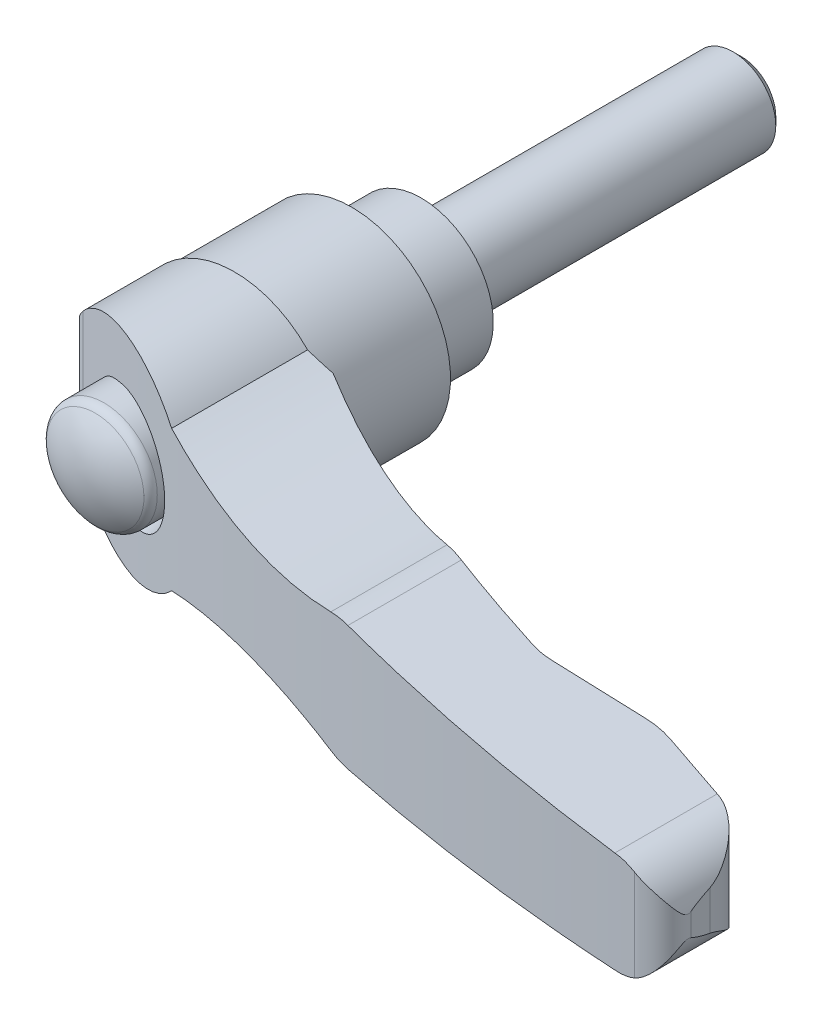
ISO-10303-21;
HEADER;
FILE_DESCRIPTION(('STEP AP214'),'2;1');
FILE_NAME('part.step','',(''),(''),'','','');
FILE_SCHEMA(('AUTOMOTIVE_DESIGN { 1 0 10303 214 1 1 1 1 }'));
ENDSEC;
DATA;
#1=APPLICATION_CONTEXT('core data for automotive mechanical design processes');
#2=APPLICATION_PROTOCOL_DEFINITION('international standard','automotive_design',2000,#1);
#3=PRODUCT_CONTEXT('',#1,'mechanical');
#4=PRODUCT('Part','Part','',(#3));
#5=PRODUCT_RELATED_PRODUCT_CATEGORY('part','',(#4));
#6=PRODUCT_DEFINITION_FORMATION('','',#4);
#7=PRODUCT_DEFINITION_CONTEXT('part definition',#1,'design');
#8=PRODUCT_DEFINITION('design','',#6,#7);
#9=PRODUCT_DEFINITION_SHAPE('','',#8);
#10=(LENGTH_UNIT() NAMED_UNIT(*) SI_UNIT(.MILLI.,.METRE.));
#11=(NAMED_UNIT(*) PLANE_ANGLE_UNIT() SI_UNIT($,.RADIAN.));
#12=(NAMED_UNIT(*) SI_UNIT($,.STERADIAN.) SOLID_ANGLE_UNIT());
#13=UNCERTAINTY_MEASURE_WITH_UNIT(LENGTH_MEASURE(1.E-05),#10,'distance_accuracy_value','');
#14=(GEOMETRIC_REPRESENTATION_CONTEXT(3) GLOBAL_UNCERTAINTY_ASSIGNED_CONTEXT((#13)) GLOBAL_UNIT_ASSIGNED_CONTEXT((#10,
#11,#12)) REPRESENTATION_CONTEXT('',''));
#15=CARTESIAN_POINT('',(0.,0.,0.));
#16=DIRECTION('',(0.,0.,1.));
#17=DIRECTION('',(1.,0.,0.));
#18=AXIS2_PLACEMENT_3D('',#15,#16,#17);
#19=CARTESIAN_POINT('',(0.,0.,-7.1165));
#20=DIRECTION('',(0.,0.,-1.));
#21=DIRECTION('',(0.,1.,0.));
#22=AXIS2_PLACEMENT_3D('',#19,#20,#21);
#23=CYLINDRICAL_SURFACE('',#22,4.);
#24=CARTESIAN_POINT('',(0.,0.,0.));
#25=DIRECTION('',(0.,0.,-1.));
#26=DIRECTION('',(0.,1.,0.));
#27=AXIS2_PLACEMENT_3D('',#24,#25,#26);
#28=CIRCLE('',#27,4.);
#29=CARTESIAN_POINT('',(0.,4.,0.));
#30=VERTEX_POINT('',#29);
#31=EDGE_CURVE('E17',#30,#30,#28,.F.);
#32=ORIENTED_EDGE('',*,*,#31,.F.);
#33=EDGE_LOOP('',(#32));
#34=FACE_BOUND('',#33,.T.);
#35=CARTESIAN_POINT('',(0.,0.,-29.2329999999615));
#36=DIRECTION('',(0.,0.,1.));
#37=DIRECTION('',(1.,0.,0.));
#38=AXIS2_PLACEMENT_3D('',#35,#36,#37);
#39=CIRCLE('',#38,4.);
#40=CARTESIAN_POINT('',(4.,0.,-29.2329999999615));
#41=VERTEX_POINT('',#40);
#42=EDGE_CURVE('E445',#41,#41,#39,.T.);
#43=ORIENTED_EDGE('',*,*,#42,.T.);
#44=EDGE_LOOP('',(#43));
#45=FACE_BOUND('',#44,.T.);
#46=ADVANCED_FACE('F14',(#34,#45),#23,.T.);
#47=CARTESIAN_POINT('',(5.375,0.,0.));
#48=DIRECTION('',(0.,0.,-1.));
#49=DIRECTION('',(0.,1.,0.));
#50=AXIS2_PLACEMENT_3D('',#47,#48,#49);
#51=PLANE('',#50);
#52=ORIENTED_EDGE('',*,*,#31,.T.);
#53=EDGE_LOOP('',(#52));
#54=FACE_BOUND('',#53,.T.);
#55=CARTESIAN_POINT('',(0.,0.,0.));
#56=DIRECTION('',(0.,0.,-1.));
#57=DIRECTION('',(0.,1.,0.));
#58=AXIS2_PLACEMENT_3D('',#55,#56,#57);
#59=CIRCLE('',#58,6.75);
#60=CARTESIAN_POINT('',(0.,6.75,0.));
#61=VERTEX_POINT('',#60);
#62=EDGE_CURVE('E194',#61,#61,#59,.F.);
#63=ORIENTED_EDGE('',*,*,#62,.F.);
#64=EDGE_LOOP('',(#63));
#65=FACE_BOUND('',#64,.T.);
#66=ADVANCED_FACE('F839',(#54,#65),#51,.T.);
#67=CARTESIAN_POINT('',(0.,0.,8.25));
#68=DIRECTION('',(0.,0.,-1.));
#69=DIRECTION('',(0.,1.,0.));
#70=AXIS2_PLACEMENT_3D('',#67,#68,#69);
#71=CYLINDRICAL_SURFACE('',#70,6.75);
#72=ORIENTED_EDGE('',*,*,#62,.T.);
#73=EDGE_LOOP('',(#72));
#74=FACE_BOUND('',#73,.T.);
#75=CARTESIAN_POINT('',(0.,0.,7.15000000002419));
#76=DIRECTION('',(0.,0.,-1.));
#77=DIRECTION('',(1.,0.,0.));
#78=AXIS2_PLACEMENT_3D('',#75,#76,#77);
#79=CIRCLE('',#78,6.74999999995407);
#80=CARTESIAN_POINT('',(6.74999999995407,0.,7.15000000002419));
#81=VERTEX_POINT('',#80);
#82=EDGE_CURVE('E192',#81,#81,#79,.T.);
#83=ORIENTED_EDGE('',*,*,#82,.T.);
#84=EDGE_LOOP('',(#83));
#85=FACE_BOUND('',#84,.T.);
#86=ADVANCED_FACE('F829',(#74,#85),#71,.T.);
#87=CARTESIAN_POINT('',(0.,0.,6.9000000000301));
#88=DIRECTION('',(0.,0.,-1.));
#89=DIRECTION('',(0.,1.,0.));
#90=AXIS2_PLACEMENT_3D('',#87,#88,#89);
#91=CONICAL_SURFACE('',#90,7.000000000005,0.785398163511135);
#92=ORIENTED_EDGE('',*,*,#82,.F.);
#93=EDGE_LOOP('',(#92));
#94=FACE_BOUND('',#93,.T.);
#95=CARTESIAN_POINT('',(0.,0.,6.9));
#96=DIRECTION('',(0.,0.,-1.));
#97=DIRECTION('',(0.,1.,0.));
#98=AXIS2_PLACEMENT_3D('',#95,#96,#97);
#99=CIRCLE('',#98,7.);
#100=CARTESIAN_POINT('',(0.,7.,6.9));
#101=VERTEX_POINT('',#100);
#102=EDGE_CURVE('E184',#101,#101,#99,.T.);
#103=ORIENTED_EDGE('',*,*,#102,.T.);
#104=EDGE_LOOP('',(#103));
#105=FACE_BOUND('',#104,.T.);
#106=ADVANCED_FACE('F819',(#94,#105),#91,.F.);
#107=CARTESIAN_POINT('',(0.,0.,6.2));
#108=DIRECTION('',(0.,0.,-1.));
#109=DIRECTION('',(0.,1.,0.));
#110=AXIS2_PLACEMENT_3D('',#107,#108,#109);
#111=CYLINDRICAL_SURFACE('',#110,7.);
#112=ORIENTED_EDGE('',*,*,#102,.F.);
#113=EDGE_LOOP('',(#112));
#114=FACE_BOUND('',#113,.T.);
#115=CARTESIAN_POINT('',(0.,0.,6.5));
#116=DIRECTION('',(0.,0.,-1.));
#117=DIRECTION('',(0.,1.,0.));
#118=AXIS2_PLACEMENT_3D('',#115,#116,#117);
#119=CIRCLE('',#118,7.);
#120=CARTESIAN_POINT('',(0.,7.,6.5));
#121=VERTEX_POINT('',#120);
#122=EDGE_CURVE('E181',#121,#121,#119,.F.);
#123=ORIENTED_EDGE('',*,*,#122,.F.);
#124=EDGE_LOOP('',(#123));
#125=FACE_BOUND('',#124,.T.);
#126=ADVANCED_FACE('F811',(#114,#125),#111,.F.);
#127=CARTESIAN_POINT('',(-9.01003775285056,-19.,6.5));
#128=DIRECTION('',(0.707106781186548,0.,0.707106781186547));
#129=DIRECTION('',(-0.707106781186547,0.,0.707106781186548));
#130=AXIS2_PLACEMENT_3D('',#127,#128,#129);
#131=PLANE('',#130);
#132=DIRECTION('',(0.,1.,0.));
#133=VECTOR('',#132,1.);
#134=CARTESIAN_POINT('',(-9.01003775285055,0.,6.5));
#135=LINE('',#134,#133);
#136=CARTESIAN_POINT('',(-9.01003775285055,-2.13584185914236,6.5));
#137=VERTEX_POINT('',#136);
#138=CARTESIAN_POINT('',(-9.01003775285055,2.13584185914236,6.5));
#139=VERTEX_POINT('',#138);
#140=EDGE_CURVE('E165',#137,#139,#135,.T.);
#141=ORIENTED_EDGE('',*,*,#140,.F.);
#142=CARTESIAN_POINT('',(-0.00999999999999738,0.,-2.50003775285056));
#143=DIRECTION('',(0.707106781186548,0.,0.707106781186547));
#144=DIRECTION('',(-0.707106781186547,0.,0.707106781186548));
#145=AXIS2_PLACEMENT_3D('',#142,#143,#144);
#146=ELLIPSE('',#145,13.0814754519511,9.25);
#147=EDGE_CURVE('E168',#139,#137,#146,.T.);
#148=ORIENTED_EDGE('',*,*,#147,.F.);
#149=EDGE_LOOP('',(#141,#148));
#150=FACE_BOUND('',#149,.T.);
#151=ADVANCED_FACE('F170',(#150),#131,.F.);
#152=CARTESIAN_POINT('',(-4.635,0.,6.5));
#153=DIRECTION('',(0.,0.,-1.));
#154=DIRECTION('',(0.,1.,0.));
#155=AXIS2_PLACEMENT_3D('',#152,#153,#154);
#156=PLANE('',#155);
#157=ORIENTED_EDGE('',*,*,#140,.T.);
#158=CARTESIAN_POINT('',(-0.00999999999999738,0.,6.5));
#159=DIRECTION('',(0.,0.,1.));
#160=DIRECTION('',(-1.,0.,0.));
#161=AXIS2_PLACEMENT_3D('',#158,#159,#160);
#162=CIRCLE('',#161,9.25);
#163=EDGE_CURVE('E172',#137,#139,#162,.T.);
#164=ORIENTED_EDGE('',*,*,#163,.F.);
#165=EDGE_LOOP('',(#157,#164));
#166=FACE_BOUND('',#165,.T.);
#167=ORIENTED_EDGE('',*,*,#122,.T.);
#168=EDGE_LOOP('',(#167));
#169=FACE_BOUND('',#168,.T.);
#170=ADVANCED_FACE('F179',(#166,#169),#156,.T.);
#171=CARTESIAN_POINT('',(-0.00999999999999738,0.,13.5625));
#172=DIRECTION('',(0.,0.,1.));
#173=DIRECTION('',(-1.,0.,0.));
#174=AXIS2_PLACEMENT_3D('',#171,#172,#173);
#175=CYLINDRICAL_SURFACE('',#174,9.25);
#176=ORIENTED_EDGE('',*,*,#163,.T.);
#177=ORIENTED_EDGE('',*,*,#147,.T.);
#178=EDGE_LOOP('',(#176,#177));
#179=FACE_BOUND('',#178,.T.);
#180=CARTESIAN_POINT('',(-0.00999999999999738,0.,17.5));
#181=DIRECTION('',(0.,0.,1.));
#182=DIRECTION('',(-1.,0.,0.));
#183=AXIS2_PLACEMENT_3D('',#180,#181,#182);
#184=CIRCLE('',#183,9.25);
#185=CARTESIAN_POINT('',(-9.26,0.,17.5));
#186=VERTEX_POINT('',#185);
#187=CARTESIAN_POINT('',(9.23999999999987,0.,17.5000000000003));
#188=VERTEX_POINT('',#187);
#189=EDGE_CURVE('E419',#186,#188,#184,.T.);
#190=ORIENTED_EDGE('',*,*,#189,.F.);
#191=CARTESIAN_POINT('',(-0.00999999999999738,0.,17.5));
#192=DIRECTION('',(0.,0.,1.));
#193=DIRECTION('',(-1.,0.,0.));
#194=AXIS2_PLACEMENT_3D('',#191,#192,#193);
#195=CIRCLE('',#194,9.25);
#196=EDGE_CURVE('E428',#188,#186,#195,.T.);
#197=ORIENTED_EDGE('',*,*,#196,.F.);
#198=EDGE_LOOP('',(#190,#197));
#199=FACE_BOUND('',#198,.T.);
#200=ADVANCED_FACE('F174',(#179,#199),#175,.T.);
#201=CARTESIAN_POINT('',(0.,0.,24.));
#202=DIRECTION('',(1.,0.,0.));
#203=DIRECTION('',(0.,0.,1.));
#204=AXIS2_PLACEMENT_3D('',#201,#202,#203);
#205=SPHERICAL_SURFACE('',#204,8.);
#206=CARTESIAN_POINT('',(0.,0.,30.5652144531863));
#207=DIRECTION('',(0.,0.,1.));
#208=DIRECTION('',(0.,-1.,0.));
#209=AXIS2_PLACEMENT_3D('',#206,#207,#208);
#210=CIRCLE('',#209,4.57142857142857);
#211=CARTESIAN_POINT('',(0.,-4.57142857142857,30.5652144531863));
#212=VERTEX_POINT('',#211);
#213=EDGE_CURVE('E403',#212,#212,#210,.F.);
#214=ORIENTED_EDGE('',*,*,#213,.F.);
#215=EDGE_LOOP('',(#214));
#216=FACE_BOUND('',#215,.T.);
#217=ADVANCED_FACE('F778',(#216),#205,.T.);
#218=CARTESIAN_POINT('',(64.6274051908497,-10.5,37.5817950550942));
#219=DIRECTION('',(0.992331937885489,0.,-0.123601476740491));
#220=DIRECTION('',(0.123601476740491,0.,0.992331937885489));
#221=AXIS2_PLACEMENT_3D('',#218,#219,#220);
#222=PLANE('',#221);
#223=CARTESIAN_POINT('',(60.25,0.,2.43788666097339));
#224=DIRECTION('',(0.992331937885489,0.,-0.123601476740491));
#225=DIRECTION('',(0.123601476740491,0.,0.992331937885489));
#226=AXIS2_PLACEMENT_3D('',#223,#224,#225);
#227=ELLIPSE('',#226,38.4299615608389,4.75);
#228=CARTESIAN_POINT('',(64.8745408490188,1.08449155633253,39.5659186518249));
#229=VERTEX_POINT('',#228);
#230=CARTESIAN_POINT('',(64.6274051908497,1.84413226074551,37.5817950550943));
#231=VERTEX_POINT('',#230);
#232=EDGE_CURVE('E555',#229,#231,#227,.F.);
#233=ORIENTED_EDGE('',*,*,#232,.F.);
#234=DIRECTION('',(0.,-1.,0.));
#235=VECTOR('',#234,1.);
#236=CARTESIAN_POINT('',(64.8745408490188,-10.5,39.5659186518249));
#237=LINE('',#236,#235);
#238=CARTESIAN_POINT('',(64.8745408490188,-1.08449155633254,39.5659186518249));
#239=VERTEX_POINT('',#238);
#240=EDGE_CURVE('E495',#239,#229,#237,.F.);
#241=ORIENTED_EDGE('',*,*,#240,.F.);
#242=CARTESIAN_POINT('',(60.25,0.,2.43788666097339));
#243=DIRECTION('',(0.992331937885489,0.,-0.123601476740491));
#244=DIRECTION('',(0.123601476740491,0.,0.992331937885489));
#245=AXIS2_PLACEMENT_3D('',#242,#243,#244);
#246=ELLIPSE('',#245,38.4299615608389,4.75);
#247=CARTESIAN_POINT('',(64.6274051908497,-1.84413226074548,37.5817950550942));
#248=VERTEX_POINT('',#247);
#249=EDGE_CURVE('E504',#248,#239,#246,.F.);
#250=ORIENTED_EDGE('',*,*,#249,.F.);
#251=DIRECTION('',(0.,-1.,0.));
#252=VECTOR('',#251,1.);
#253=CARTESIAN_POINT('',(64.6274051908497,-10.5,37.5817950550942));
#254=LINE('',#253,#252);
#255=EDGE_CURVE('E177',#231,#248,#254,.T.);
#256=ORIENTED_EDGE('',*,*,#255,.F.);
#257=EDGE_LOOP('',(#233,#241,#250,#256));
#258=FACE_BOUND('',#257,.T.);
#259=ADVANCED_FACE('F543',(#258),#222,.T.);
#260=CARTESIAN_POINT('',(58.6337202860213,-10.5,38.3283479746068));
#261=DIRECTION('',(0.,-1.,0.));
#262=DIRECTION('',(1.,0.,0.));
#263=AXIS2_PLACEMENT_3D('',#260,#261,#262);
#264=CYLINDRICAL_SURFACE('',#263,6.04);
#265=CARTESIAN_POINT('',(64.6274051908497,1.84413226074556,37.5817950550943));
#266=CARTESIAN_POINT('',(64.6175868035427,1.86745330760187,37.5030045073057));
#267=CARTESIAN_POINT('',(64.6063375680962,1.89362327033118,37.4253204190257));
#268=CARTESIAN_POINT('',(64.5811702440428,1.95049016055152,37.2721928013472));
#269=CARTESIAN_POINT('',(64.5672561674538,1.98118026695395,37.196746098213));
#270=CARTESIAN_POINT('',(64.5369883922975,2.04585034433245,37.0482136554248));
#271=CARTESIAN_POINT('',(64.520645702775,2.07981523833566,36.9751189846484));
#272=CARTESIAN_POINT('',(64.4855821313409,2.15032519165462,36.8307396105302));
#273=CARTESIAN_POINT('',(64.4668602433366,2.18687133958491,36.7594556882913));
#274=CARTESIAN_POINT('',(64.4072221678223,2.29938724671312,36.547961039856));
#275=CARTESIAN_POINT('',(64.3628565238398,2.37818379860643,36.410218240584));
#276=CARTESIAN_POINT('',(64.2652007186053,2.53960895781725,36.1400450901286));
#277=CARTESIAN_POINT('',(64.2118976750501,2.6222429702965,36.007622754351));
#278=CARTESIAN_POINT('',(64.077119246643,2.81672317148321,35.7040219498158));
#279=CARTESIAN_POINT('',(63.9921849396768,2.92909268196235,35.5347005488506));
#280=CARTESIAN_POINT('',(63.8063278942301,3.15216626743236,35.2039790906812));
#281=CARTESIAN_POINT('',(63.7054078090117,3.26287061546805,35.0425777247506));
#282=CARTESIAN_POINT('',(63.4870671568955,3.47959027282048,34.7278934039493));
#283=CARTESIAN_POINT('',(63.369645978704,3.58560540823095,34.5746107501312));
#284=CARTESIAN_POINT('',(63.1179209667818,3.7899652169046,34.277236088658));
#285=CARTESIAN_POINT('',(62.9836257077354,3.88831374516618,34.1331394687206));
#286=CARTESIAN_POINT('',(62.6561598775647,4.10136712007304,33.815313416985));
#287=CARTESIAN_POINT('',(62.4571888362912,4.2125890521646,33.6450495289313));
#288=CARTESIAN_POINT('',(62.1378586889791,4.36029911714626,33.4069452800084));
#289=CARTESIAN_POINT('',(62.0281124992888,4.40629516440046,33.330558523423));
#290=CARTESIAN_POINT('',(61.8018114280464,4.49098569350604,33.1841350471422));
#291=CARTESIAN_POINT('',(61.6852609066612,4.52968478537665,33.1140943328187));
#292=CARTESIAN_POINT('',(61.4786111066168,4.58924867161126,32.9993621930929));
#293=CARTESIAN_POINT('',(61.3900115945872,4.61209493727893,32.9529824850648));
#294=CARTESIAN_POINT('',(61.209734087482,4.65295056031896,32.8642982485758));
#295=CARTESIAN_POINT('',(61.1180570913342,4.67096147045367,32.82199241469));
#296=CARTESIAN_POINT('',(60.9313596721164,4.70183469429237,32.7415027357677));
#297=CARTESIAN_POINT('',(60.8363219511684,4.71466416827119,32.7033462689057));
#298=CARTESIAN_POINT('',(60.6438287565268,4.73463763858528,32.631712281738));
#299=CARTESIAN_POINT('',(60.5463713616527,4.74177695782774,32.5982386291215));
#300=CARTESIAN_POINT('',(60.4479724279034,4.74587261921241,32.5672639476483));
#301=B_SPLINE_CURVE_WITH_KNOTS('',3,(#265,#266,#267,#268,#269,#270,#271,#272,#273,#274,#275,
#276,#277,#278,#279,#280,#281,#282,#283,#284,#285,#286,#287,#288,#289,#290,#291,#292,#293,#294,
#295,#296,#297,#298,#299,#300),.UNSPECIFIED.,.F.,.F.,(4,2,2,2,2,2,2,2,2,2,2,2,2,2,2,2,2,4),(0.,
0.248076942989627,0.495783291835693,0.742399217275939,0.989119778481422,1.48293160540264,
1.97746142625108,2.63745339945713,3.29733594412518,3.95724294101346,4.61681594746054,
5.46693586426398,5.89075482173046,6.31430511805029,6.62183365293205,6.92926331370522,
7.23861197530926,7.54821464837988),.UNSPECIFIED.);
#302=CARTESIAN_POINT('',(60.4479724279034,4.74587261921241,32.5672639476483));
#303=VERTEX_POINT('',#302);
#304=EDGE_CURVE('E494',#231,#303,#301,.T.);
#305=ORIENTED_EDGE('',*,*,#304,.F.);
#306=ORIENTED_EDGE('',*,*,#255,.T.);
#307=CARTESIAN_POINT('',(60.4479724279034,-4.74587261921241,32.5672639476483));
#308=CARTESIAN_POINT('',(60.5755504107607,-4.74057354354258,32.6074069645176));
#309=CARTESIAN_POINT('',(60.7015088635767,-4.73014540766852,32.6517620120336));
#310=CARTESIAN_POINT('',(60.9490652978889,-4.69992242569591,32.7481786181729));
#311=CARTESIAN_POINT('',(61.0706698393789,-4.6801423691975,32.8002279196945));
#312=CARTESIAN_POINT('',(61.3074659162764,-4.63235500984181,32.9108206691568));
#313=CARTESIAN_POINT('',(61.4227141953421,-4.60444273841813,32.9692844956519));
#314=CARTESIAN_POINT('',(61.6477173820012,-4.54120548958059,33.0925213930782));
#315=CARTESIAN_POINT('',(61.7574696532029,-4.50587699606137,33.1572974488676));
#316=CARTESIAN_POINT('',(61.9940137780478,-4.42040174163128,33.307032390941));
#317=CARTESIAN_POINT('',(62.1193938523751,-4.36870213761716,33.3933358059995));
#318=CARTESIAN_POINT('',(62.3610721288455,-4.25718277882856,33.5732278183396));
#319=CARTESIAN_POINT('',(62.4773638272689,-4.19735729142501,33.6668215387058));
#320=CARTESIAN_POINT('',(62.7012840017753,-4.07066877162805,33.8608437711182));
#321=CARTESIAN_POINT('',(62.8088611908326,-4.00376876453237,33.9613071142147));
#322=CARTESIAN_POINT('',(63.0146476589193,-3.86453813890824,34.1677809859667));
#323=CARTESIAN_POINT('',(63.1128596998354,-3.79220913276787,34.2737898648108));
#324=CARTESIAN_POINT('',(63.3331746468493,-3.6170051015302,34.5290929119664));
#325=CARTESIAN_POINT('',(63.4514763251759,-3.51235864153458,34.6804594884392));
#326=CARTESIAN_POINT('',(63.6718053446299,-3.29808480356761,34.9913387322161));
#327=CARTESIAN_POINT('',(63.7738256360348,-3.18845529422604,35.1508548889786));
#328=CARTESIAN_POINT('',(63.961662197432,-2.96765680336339,35.4770445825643));
#329=CARTESIAN_POINT('',(64.0475378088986,-2.85649513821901,35.6436890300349));
#330=CARTESIAN_POINT('',(64.2038484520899,-2.63586419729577,35.9851508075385));
#331=CARTESIAN_POINT('',(64.2742871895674,-2.52639452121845,36.1599661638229));
#332=CARTESIAN_POINT('',(64.3705847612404,-2.36382517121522,36.4361542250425));
#333=CARTESIAN_POINT('',(64.4019853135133,-2.30809068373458,36.5340606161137));
#334=CARTESIAN_POINT('',(64.4601539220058,-2.20019362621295,36.7330390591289));
#335=CARTESIAN_POINT('',(64.4869269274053,-2.14802727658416,36.8341075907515));
#336=CARTESIAN_POINT('',(64.5357331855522,-2.0489078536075,37.0402846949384));
#337=CARTESIAN_POINT('',(64.5577546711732,-2.00196785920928,37.1454025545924));
#338=CARTESIAN_POINT('',(64.5966140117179,-1.91618262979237,37.360168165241));
#339=CARTESIAN_POINT('',(64.6134353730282,-1.87736327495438,37.4698291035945));
#340=CARTESIAN_POINT('',(64.6274051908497,-1.84413226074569,37.5817950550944));
#341=B_SPLINE_CURVE_WITH_KNOTS('',3,(#307,#308,#309,#310,#311,#312,#313,#314,#315,#316,#317,
#318,#319,#320,#321,#322,#323,#324,#325,#326,#327,#328,#329,#330,#331,#332,#333,#334,#335,#336,
#337,#338,#339,#340),.UNSPECIFIED.,.F.,.F.,(4,2,2,2,2,2,2,2,2,2,2,2,2,2,2,2,4),(0.,
0.401264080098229,0.801895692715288,1.19802151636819,1.5943355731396,2.07588331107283,
2.55777255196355,3.04231807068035,3.52672024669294,4.18208013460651,4.83772302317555,
5.49090678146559,6.14393356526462,6.4946438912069,6.84497677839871,7.19616755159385,
7.54846105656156),.UNSPECIFIED.);
#342=CARTESIAN_POINT('',(60.4479724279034,-4.74587261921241,32.5672639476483));
#343=VERTEX_POINT('',#342);
#344=EDGE_CURVE('E507',#343,#248,#341,.T.);
#345=ORIENTED_EDGE('',*,*,#344,.F.);
#346=DIRECTION('',(0.,-1.,0.));
#347=VECTOR('',#346,1.);
#348=CARTESIAN_POINT('',(60.4479724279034,-10.5,32.5672639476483));
#349=LINE('',#348,#347);
#350=EDGE_CURVE('E417',#303,#343,#349,.T.);
#351=ORIENTED_EDGE('',*,*,#350,.F.);
#352=EDGE_LOOP('',(#305,#306,#345,#351));
#353=FACE_BOUND('',#352,.T.);
#354=ADVANCED_FACE('F537',(#353),#264,.T.);
#355=CARTESIAN_POINT('',(-9.26,-10.5,17.5));
#356=DIRECTION('',(0.,0.,-1.));
#357=DIRECTION('',(0.,1.,0.));
#358=AXIS2_PLACEMENT_3D('',#355,#356,#357);
#359=PLANE('',#358);
#360=DIRECTION('',(0.,-1.,0.));
#361=VECTOR('',#360,1.);
#362=CARTESIAN_POINT('',(-9.26,-10.5,17.5));
#363=LINE('',#362,#361);
#364=CARTESIAN_POINT('',(-9.26,2.12188595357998,17.5));
#365=VERTEX_POINT('',#364);
#366=EDGE_CURVE('E426',#365,#186,#363,.T.);
#367=ORIENTED_EDGE('',*,*,#366,.F.);
#368=CARTESIAN_POINT('',(0.,0.,17.5));
#369=DIRECTION('',(0.,0.,1.));
#370=DIRECTION('',(0.,-1.,0.));
#371=AXIS2_PLACEMENT_3D('',#368,#369,#370);
#372=CIRCLE('',#371,9.5);
#373=CARTESIAN_POINT('',(6.8437408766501,6.58887022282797,17.5));
#374=VERTEX_POINT('',#373);
#375=EDGE_CURVE('E340',#374,#365,#372,.T.);
#376=ORIENTED_EDGE('',*,*,#375,.F.);
#377=CARTESIAN_POINT('',(19.25,44.09,17.5));
#378=DIRECTION('',(0.,0.,1.));
#379=DIRECTION('',(0.,-1.,0.));
#380=AXIS2_PLACEMENT_3D('',#377,#378,#379);
#381=CIRCLE('',#380,39.5);
#382=CARTESIAN_POINT('',(9.23999999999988,5.8794006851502,17.5000000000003));
#383=VERTEX_POINT('',#382);
#384=EDGE_CURVE('E300',#374,#383,#381,.T.);
#385=ORIENTED_EDGE('',*,*,#384,.T.);
#386=DIRECTION('',(0.,-1.,0.));
#387=VECTOR('',#386,1.);
#388=CARTESIAN_POINT('',(9.23999999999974,-10.5,17.5000000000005));
#389=LINE('',#388,#387);
#390=EDGE_CURVE('E406',#383,#188,#389,.T.);
#391=ORIENTED_EDGE('',*,*,#390,.T.);
#392=ORIENTED_EDGE('',*,*,#196,.T.);
#393=EDGE_LOOP('',(#367,#376,#385,#391,#392));
#394=FACE_BOUND('',#393,.T.);
#395=ADVANCED_FACE('F542',(#394),#359,.T.);
#396=CARTESIAN_POINT('',(-9.26,-10.5,21.2038249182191));
#397=DIRECTION('',(-1.,0.,0.));
#398=DIRECTION('',(0.,-1.,0.));
#399=AXIS2_PLACEMENT_3D('',#396,#397,#398);
#400=PLANE('',#399);
#401=ORIENTED_EDGE('',*,*,#366,.T.);
#402=DIRECTION('',(0.,1.,0.));
#403=VECTOR('',#402,1.);
#404=CARTESIAN_POINT('',(-9.26,-10.5,17.5));
#405=LINE('',#404,#403);
#406=CARTESIAN_POINT('',(-9.26,-2.12188595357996,17.5));
#407=VERTEX_POINT('',#406);
#408=EDGE_CURVE('E420',#407,#186,#405,.T.);
#409=ORIENTED_EDGE('',*,*,#408,.F.);
#410=DIRECTION('',(0.,0.,1.));
#411=VECTOR('',#410,1.);
#412=CARTESIAN_POINT('',(-9.26,-2.12188595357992,42.5));
#413=LINE('',#412,#411);
#414=CARTESIAN_POINT('',(-9.26,-2.12188595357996,21.2038249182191));
#415=VERTEX_POINT('',#414);
#416=EDGE_CURVE('E423',#415,#407,#413,.F.);
#417=ORIENTED_EDGE('',*,*,#416,.F.);
#418=DIRECTION('',(0.,-1.,0.));
#419=VECTOR('',#418,1.);
#420=CARTESIAN_POINT('',(-9.26,-10.5,21.2038249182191));
#421=LINE('',#420,#419);
#422=CARTESIAN_POINT('',(-9.26,2.12188595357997,21.2038249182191));
#423=VERTEX_POINT('',#422);
#424=EDGE_CURVE('E475',#423,#415,#421,.T.);
#425=ORIENTED_EDGE('',*,*,#424,.F.);
#426=DIRECTION('',(0.,0.,1.));
#427=VECTOR('',#426,1.);
#428=CARTESIAN_POINT('',(-9.26,2.12188595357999,42.5));
#429=LINE('',#428,#427);
#430=EDGE_CURVE('E343',#365,#423,#429,.T.);
#431=ORIENTED_EDGE('',*,*,#430,.F.);
#432=EDGE_LOOP('',(#401,#409,#417,#425,#431));
#433=FACE_BOUND('',#432,.T.);
#434=ADVANCED_FACE('F740',(#433),#400,.T.);
#435=CARTESIAN_POINT('',(-9.26,-10.5,17.5));
#436=DIRECTION('',(0.,0.,-1.));
#437=DIRECTION('',(0.,1.,0.));
#438=AXIS2_PLACEMENT_3D('',#435,#436,#437);
#439=PLANE('',#438);
#440=DIRECTION('',(0.,-1.,0.));
#441=VECTOR('',#440,1.);
#442=CARTESIAN_POINT('',(9.23999999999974,-10.5,17.5000000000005));
#443=LINE('',#442,#441);
#444=CARTESIAN_POINT('',(9.23999999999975,-5.87940068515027,17.5000000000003));
#445=VERTEX_POINT('',#444);
#446=EDGE_CURVE('E404',#188,#445,#443,.T.);
#447=ORIENTED_EDGE('',*,*,#446,.T.);
#448=CARTESIAN_POINT('',(19.25,-44.09,17.5));
#449=DIRECTION('',(0.,0.,1.));
#450=DIRECTION('',(0.,-1.,0.));
#451=AXIS2_PLACEMENT_3D('',#448,#449,#450);
#452=CIRCLE('',#451,39.5);
#453=CARTESIAN_POINT('',(6.84374087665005,-6.588870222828,17.5));
#454=VERTEX_POINT('',#453);
#455=EDGE_CURVE('E474',#445,#454,#452,.T.);
#456=ORIENTED_EDGE('',*,*,#455,.T.);
#457=CARTESIAN_POINT('',(0.,0.,17.5));
#458=DIRECTION('',(0.,0.,1.));
#459=DIRECTION('',(0.,-1.,0.));
#460=AXIS2_PLACEMENT_3D('',#457,#458,#459);
#461=CIRCLE('',#460,9.5);
#462=EDGE_CURVE('E478',#407,#454,#461,.T.);
#463=ORIENTED_EDGE('',*,*,#462,.F.);
#464=ORIENTED_EDGE('',*,*,#408,.T.);
#465=ORIENTED_EDGE('',*,*,#189,.T.);
#466=EDGE_LOOP('',(#447,#456,#463,#464,#465));
#467=FACE_BOUND('',#466,.T.);
#468=ADVANCED_FACE('F732',(#467),#439,.T.);
#469=CARTESIAN_POINT('',(53.8294507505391,-10.5,30.4829917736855));
#470=DIRECTION('',(0.300372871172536,0.,-0.953821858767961));
#471=DIRECTION('',(0.953821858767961,0.,0.300372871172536));
#472=AXIS2_PLACEMENT_3D('',#469,#470,#471);
#473=PLANE('',#472);
#474=CARTESIAN_POINT('',(60.25,0.,32.5049194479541));
#475=DIRECTION('',(0.300372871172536,0.,-0.953821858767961));
#476=DIRECTION('',(0.953821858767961,0.,0.300372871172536));
#477=AXIS2_PLACEMENT_3D('',#474,#475,#476);
#478=ELLIPSE('',#477,4.97996555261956,4.75);
#479=CARTESIAN_POINT('',(60.25,4.75,32.5049194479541));
#480=VERTEX_POINT('',#479);
#481=EDGE_CURVE('E496',#303,#480,#478,.F.);
#482=ORIENTED_EDGE('',*,*,#481,.F.);
#483=ORIENTED_EDGE('',*,*,#350,.T.);
#484=CARTESIAN_POINT('',(60.25,0.,32.5049194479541));
#485=DIRECTION('',(0.300372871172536,0.,-0.953821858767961));
#486=DIRECTION('',(0.953821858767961,0.,0.300372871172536));
#487=AXIS2_PLACEMENT_3D('',#484,#485,#486);
#488=ELLIPSE('',#487,4.97996555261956,4.75);
#489=CARTESIAN_POINT('',(60.25,-4.75,32.5049194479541));
#490=VERTEX_POINT('',#489);
#491=EDGE_CURVE('E536',#490,#343,#488,.F.);
#492=ORIENTED_EDGE('',*,*,#491,.F.);
#493=DIRECTION('',(-0.953255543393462,-0.0344545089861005,-0.300194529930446));
#494=VECTOR('',#493,1.);
#495=CARTESIAN_POINT('',(60.25,-4.75,32.5049194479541));
#496=LINE('',#495,#494);
#497=CARTESIAN_POINT('',(53.8294507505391,-4.98206460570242,30.4829917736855));
#498=VERTEX_POINT('',#497);
#499=EDGE_CURVE('E464',#490,#498,#496,.T.);
#500=ORIENTED_EDGE('',*,*,#499,.T.);
#501=DIRECTION('',(0.,-1.,0.));
#502=VECTOR('',#501,1.);
#503=CARTESIAN_POINT('',(53.8294507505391,-10.5,30.4829917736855));
#504=LINE('',#503,#502);
#505=CARTESIAN_POINT('',(53.8294507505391,4.98206460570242,30.4829917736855));
#506=VERTEX_POINT('',#505);
#507=EDGE_CURVE('E414',#506,#498,#504,.T.);
#508=ORIENTED_EDGE('',*,*,#507,.F.);
#509=DIRECTION('',(0.953255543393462,-0.0344545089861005,0.300194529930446));
#510=VECTOR('',#509,1.);
#511=CARTESIAN_POINT('',(53.8294507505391,4.98206460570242,30.4829917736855));
#512=LINE('',#511,#510);
#513=EDGE_CURVE('E299',#506,#480,#512,.T.);
#514=ORIENTED_EDGE('',*,*,#513,.T.);
#515=EDGE_LOOP('',(#482,#483,#492,#500,#508,#514));
#516=FACE_BOUND('',#515,.T.);
#517=ADVANCED_FACE('F573',(#516),#473,.T.);
#518=CARTESIAN_POINT('',(51.0780352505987,-10.5,39.22));
#519=DIRECTION('',(0.,-1.,0.));
#520=DIRECTION('',(1.,0.,0.));
#521=AXIS2_PLACEMENT_3D('',#518,#519,#520);
#522=CYLINDRICAL_SURFACE('',#521,9.15999999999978);
#523=CARTESIAN_POINT('',(51.0780352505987,5.08151188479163,39.22));
#524=DIRECTION('',(-0.0361204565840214,-0.999347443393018,0.));
#525=DIRECTION('',(0.999347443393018,-0.0361204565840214,0.));
#526=AXIS2_PLACEMENT_3D('',#523,#524,#525);
#527=ELLIPSE('',#526,9.16598132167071,9.15999999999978);
#528=CARTESIAN_POINT('',(51.0780352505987,5.08151188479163,30.06));
#529=VERTEX_POINT('',#528);
#530=EDGE_CURVE('E302',#529,#506,#527,.T.);
#531=ORIENTED_EDGE('',*,*,#530,.T.);
#532=ORIENTED_EDGE('',*,*,#507,.T.);
#533=CARTESIAN_POINT('',(51.0780352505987,-5.08151188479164,39.22));
#534=DIRECTION('',(-0.0361204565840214,0.999347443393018,0.));
#535=DIRECTION('',(-0.999347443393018,-0.0361204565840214,0.));
#536=AXIS2_PLACEMENT_3D('',#533,#534,#535);
#537=ELLIPSE('',#536,9.16598132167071,9.15999999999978);
#538=CARTESIAN_POINT('',(51.0780352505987,-5.08151188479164,30.06));
#539=VERTEX_POINT('',#538);
#540=EDGE_CURVE('E463',#498,#539,#537,.T.);
#541=ORIENTED_EDGE('',*,*,#540,.T.);
#542=DIRECTION('',(0.,1.,0.));
#543=VECTOR('',#542,1.);
#544=CARTESIAN_POINT('',(51.0780352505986,-10.5,30.06));
#545=LINE('',#544,#543);
#546=EDGE_CURVE('E411',#529,#539,#545,.F.);
#547=ORIENTED_EDGE('',*,*,#546,.F.);
#548=EDGE_LOOP('',(#531,#532,#541,#547));
#549=FACE_BOUND('',#548,.T.);
#550=ADVANCED_FACE('F716',(#549),#522,.T.);
#551=CARTESIAN_POINT('',(42.239481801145,-10.5,30.06));
#552=DIRECTION('',(0.,0.,-1.));
#553=DIRECTION('',(0.,1.,0.));
#554=AXIS2_PLACEMENT_3D('',#551,#552,#553);
#555=PLANE('',#554);
#556=DIRECTION('',(0.999347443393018,-0.0361204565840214,0.));
#557=VECTOR('',#556,1.);
#558=CARTESIAN_POINT('',(30.3472861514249,5.83080496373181,30.06));
#559=LINE('',#558,#557);
#560=CARTESIAN_POINT('',(42.239481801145,5.4009729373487,30.06));
#561=VERTEX_POINT('',#560);
#562=EDGE_CURVE('E488',#561,#529,#559,.T.);
#563=ORIENTED_EDGE('',*,*,#562,.T.);
#564=ORIENTED_EDGE('',*,*,#546,.T.);
#565=DIRECTION('',(-0.999347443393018,-0.0361204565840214,0.));
#566=VECTOR('',#565,1.);
#567=CARTESIAN_POINT('',(60.25,-4.75,30.06));
#568=LINE('',#567,#566);
#569=CARTESIAN_POINT('',(42.239481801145,-5.4009729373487,30.06));
#570=VERTEX_POINT('',#569);
#571=EDGE_CURVE('E460',#539,#570,#568,.T.);
#572=ORIENTED_EDGE('',*,*,#571,.T.);
#573=DIRECTION('',(0.,-1.,0.));
#574=VECTOR('',#573,1.);
#575=CARTESIAN_POINT('',(42.239481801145,-10.5,30.06));
#576=LINE('',#575,#574);
#577=EDGE_CURVE('E409',#570,#561,#576,.F.);
#578=ORIENTED_EDGE('',*,*,#577,.T.);
#579=EDGE_LOOP('',(#563,#564,#572,#578));
#580=FACE_BOUND('',#579,.T.);
#581=ADVANCED_FACE('F708',(#580),#555,.T.);
#582=CARTESIAN_POINT('',(42.2394818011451,-10.5,23.0799999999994));
#583=DIRECTION('',(0.,-1.,0.));
#584=DIRECTION('',(1.,0.,0.));
#585=AXIS2_PLACEMENT_3D('',#582,#583,#584);
#586=CYLINDRICAL_SURFACE('',#585,6.98000000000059);
#587=DIRECTION('',(0.,-1.,0.));
#588=VECTOR('',#587,1.);
#589=CARTESIAN_POINT('',(40.3024609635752,-10.5,29.785844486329));
#590=LINE('',#589,#588);
#591=CARTESIAN_POINT('',(40.3024609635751,-5.47098470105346,29.7858444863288));
#592=VERTEX_POINT('',#591);
#593=CARTESIAN_POINT('',(40.3024609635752,5.47098470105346,29.7858444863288));
#594=VERTEX_POINT('',#593);
#595=EDGE_CURVE('E401',#592,#594,#590,.F.);
#596=ORIENTED_EDGE('',*,*,#595,.T.);
#597=CARTESIAN_POINT('',(42.2394818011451,5.40097293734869,23.0799999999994));
#598=DIRECTION('',(-0.0361204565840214,-0.999347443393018,0.));
#599=DIRECTION('',(0.999347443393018,-0.0361204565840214,0.));
#600=AXIS2_PLACEMENT_3D('',#597,#598,#599);
#601=ELLIPSE('',#600,6.98455781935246,6.98000000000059);
#602=EDGE_CURVE('E491',#594,#561,#601,.F.);
#603=ORIENTED_EDGE('',*,*,#602,.T.);
#604=ORIENTED_EDGE('',*,*,#577,.F.);
#605=CARTESIAN_POINT('',(42.2394818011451,-5.4009729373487,23.0799999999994));
#606=DIRECTION('',(-0.0361204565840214,0.999347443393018,0.));
#607=DIRECTION('',(-0.999347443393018,-0.0361204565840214,0.));
#608=AXIS2_PLACEMENT_3D('',#605,#606,#607);
#609=ELLIPSE('',#608,6.98455781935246,6.98000000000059);
#610=EDGE_CURVE('E462',#570,#592,#609,.F.);
#611=ORIENTED_EDGE('',*,*,#610,.T.);
#612=EDGE_LOOP('',(#596,#603,#604,#611));
#613=FACE_BOUND('',#612,.T.);
#614=ADVANCED_FACE('F310',(#613),#586,.F.);
#615=CARTESIAN_POINT('',(88.9416647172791,-10.5,-138.600024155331));
#616=DIRECTION('',(0.,-1.,0.));
#617=DIRECTION('',(1.,0.,0.));
#618=AXIS2_PLACEMENT_3D('',#615,#616,#617);
#619=CYLINDRICAL_SURFACE('',#618,175.27);
#620=CARTESIAN_POINT('',(30.3472861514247,5.83080496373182,26.5855433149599));
#621=CARTESIAN_POINT('',(30.1696679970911,5.83722947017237,26.5225405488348));
#622=CARTESIAN_POINT('',(29.9919650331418,5.83772087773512,26.45918181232));
#623=CARTESIAN_POINT('',(29.6377732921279,5.82691956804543,26.3322542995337));
#624=CARTESIAN_POINT('',(29.461282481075,5.81567269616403,26.2686872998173));
#625=CARTESIAN_POINT('',(29.1095062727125,5.78152581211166,26.1413510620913));
#626=CARTESIAN_POINT('',(28.9342208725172,5.75862582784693,26.0775818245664));
#627=CARTESIAN_POINT('',(28.5848474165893,5.70116062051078,25.9498538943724));
#628=CARTESIAN_POINT('',(28.4107667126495,5.6665501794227,25.8858954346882));
#629=CARTESIAN_POINT('',(28.2379732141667,5.62616845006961,25.8220994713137));
#630=B_SPLINE_CURVE_WITH_KNOTS('',3,(#620,#621,#622,#623,#624,#625,#626,#627,#628,#629),
.UNSPECIFIED.,.F.,.F.,(4,2,2,2,4),(0.,0.565613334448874,1.1290258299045,1.69243697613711,
2.2580489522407),.UNSPECIFIED.);
#631=CARTESIAN_POINT('',(30.3472861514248,5.83080496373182,26.5855433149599));
#632=VERTEX_POINT('',#631);
#633=CARTESIAN_POINT('',(28.2379732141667,5.62616845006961,25.8220994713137));
#634=VERTEX_POINT('',#633);
#635=EDGE_CURVE('E290',#632,#634,#630,.T.);
#636=ORIENTED_EDGE('',*,*,#635,.F.);
#637=CARTESIAN_POINT('',(88.9416647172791,3.71296724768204,-138.600024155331));
#638=DIRECTION('',(-0.0361204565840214,-0.999347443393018,0.));
#639=DIRECTION('',(0.999347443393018,-0.0361204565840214,0.));
#640=AXIS2_PLACEMENT_3D('',#637,#638,#639);
#641=ELLIPSE('',#640,175.384448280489,175.27);
#642=EDGE_CURVE('E493',#632,#594,#641,.F.);
#643=ORIENTED_EDGE('',*,*,#642,.T.);
#644=ORIENTED_EDGE('',*,*,#595,.F.);
#645=CARTESIAN_POINT('',(88.9416647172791,-3.71296724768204,-138.600024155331));
#646=DIRECTION('',(-0.0361204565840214,0.999347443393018,0.));
#647=DIRECTION('',(-0.999347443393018,-0.0361204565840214,0.));
#648=AXIS2_PLACEMENT_3D('',#645,#646,#647);
#649=ELLIPSE('',#648,175.384448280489,175.27);
#650=CARTESIAN_POINT('',(30.3472861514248,-5.83080496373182,26.5855433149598));
#651=VERTEX_POINT('',#650);
#652=EDGE_CURVE('E396',#592,#651,#649,.F.);
#653=ORIENTED_EDGE('',*,*,#652,.T.);
#654=CARTESIAN_POINT('',(28.237973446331,-5.6261685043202,25.8220995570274));
#655=CARTESIAN_POINT('',(28.4107669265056,-5.66655022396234,25.8858955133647));
#656=CARTESIAN_POINT('',(28.584847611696,-5.70116065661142,25.9498539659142));
#657=CARTESIAN_POINT('',(28.9342210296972,-5.75862584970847,26.0775818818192));
#658=CARTESIAN_POINT('',(29.1095064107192,-5.78152582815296,26.1413511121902));
#659=CARTESIAN_POINT('',(29.461282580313,-5.81567270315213,26.2686873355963));
#660=CARTESIAN_POINT('',(29.6377733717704,-5.82691957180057,26.3322543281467));
#661=CARTESIAN_POINT('',(29.9919650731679,-5.83772087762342,26.4591818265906));
#662=CARTESIAN_POINT('',(30.169668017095,-5.83722946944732,26.5225405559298));
#663=CARTESIAN_POINT('',(30.3472861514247,-5.83080496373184,26.5855433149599));
#664=B_SPLINE_CURVE_WITH_KNOTS('',3,(#654,#655,#656,#657,#658,#659,#660,#661,#662,#663),
.UNSPECIFIED.,.F.,.F.,(4,2,2,2,4),(0.,0.565611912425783,1.12902299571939,1.69243542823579,
2.25804869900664),.UNSPECIFIED.);
#665=CARTESIAN_POINT('',(28.237973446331,-5.6261685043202,25.8220995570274));
#666=VERTEX_POINT('',#665);
#667=EDGE_CURVE('E327',#666,#651,#664,.T.);
#668=ORIENTED_EDGE('',*,*,#667,.F.);
#669=CARTESIAN_POINT('',(28.237973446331,-5.6261685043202,25.8220995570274));
#670=CARTESIAN_POINT('',(27.6467124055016,-5.48799745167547,25.6038196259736));
#671=CARTESIAN_POINT('',(27.0537779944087,-5.3638308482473,25.3812778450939));
#672=CARTESIAN_POINT('',(25.8659006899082,-5.14331117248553,24.9280288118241));
#673=CARTESIAN_POINT('',(25.2709579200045,-5.04695642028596,24.6973220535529));
#674=CARTESIAN_POINT('',(24.0803912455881,-4.88185687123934,24.2280988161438));
#675=CARTESIAN_POINT('',(23.4847674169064,-4.81310925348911,23.9895831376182));
#676=CARTESIAN_POINT('',(22.2940534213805,-4.70292970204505,23.5051335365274));
#677=CARTESIAN_POINT('',(21.6989632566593,-4.66149787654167,23.2591995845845));
#678=CARTESIAN_POINT('',(19.93823636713,-4.57874286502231,22.520112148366));
#679=CARTESIAN_POINT('',(18.7748149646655,-4.57591682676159,22.0168726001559));
#680=CARTESIAN_POINT('',(16.4631439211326,-4.67145944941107,20.9870607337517));
#681=CARTESIAN_POINT('',(15.3148886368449,-4.76978933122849,20.4604974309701));
#682=CARTESIAN_POINT('',(13.7610005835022,-4.97097993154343,19.7276539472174));
#683=CARTESIAN_POINT('',(13.3455946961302,-5.03153416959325,19.5297267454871));
#684=CARTESIAN_POINT('',(12.518128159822,-5.16561835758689,19.1314774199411));
#685=CARTESIAN_POINT('',(12.1060667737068,-5.23914536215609,18.9311558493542));
#686=CARTESIAN_POINT('',(11.282699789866,-5.39957122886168,18.526898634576));
#687=CARTESIAN_POINT('',(10.8714191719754,-5.48655913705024,18.3229475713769));
#688=CARTESIAN_POINT('',(10.0527171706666,-5.67338492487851,17.9129677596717));
#689=CARTESIAN_POINT('',(9.64529662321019,-5.77322552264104,17.7069385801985));
#690=CARTESIAN_POINT('',(9.23999999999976,-5.87940068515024,17.5000000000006));
#691=B_SPLINE_CURVE_WITH_KNOTS('',3,(#669,#670,#671,#672,#673,#674,#675,#676,#677,#678,#679,
#680,#681,#682,#683,#684,#685,#686,#687,#688,#689,#690),.UNSPECIFIED.,.F.,.F.,(4,2,2,2,2,2,2,2,
2,2,4),(0.,1.93549726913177,3.87087760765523,5.80606013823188,7.74125033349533,11.5393004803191,
15.3358951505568,16.7281050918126,18.1199993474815,19.5215293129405,20.9233561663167),.UNSPECIFIED.);
#692=EDGE_CURVE('E318',#666,#445,#691,.T.);
#693=ORIENTED_EDGE('',*,*,#692,.T.);
#694=ORIENTED_EDGE('',*,*,#446,.F.);
#695=ORIENTED_EDGE('',*,*,#390,.F.);
#696=CARTESIAN_POINT('',(9.23999999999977,5.87940068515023,17.5000000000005));
#697=CARTESIAN_POINT('',(9.79948003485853,5.73283344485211,17.7856672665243));
#698=CARTESIAN_POINT('',(10.363016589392,5.59833643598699,18.0695987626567));
#699=CARTESIAN_POINT('',(11.4974282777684,5.35391463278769,18.6334448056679));
#700=CARTESIAN_POINT('',(12.068303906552,5.24399150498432,18.9133590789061));
#701=CARTESIAN_POINT('',(13.2171050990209,5.04907387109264,19.4688580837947));
#702=CARTESIAN_POINT('',(13.795037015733,4.9641038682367,19.7444383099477));
#703=CARTESIAN_POINT('',(14.9564491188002,4.81968144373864,20.2904183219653));
#704=CARTESIAN_POINT('',(15.5399291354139,4.7602282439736,20.56081826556));
#705=CARTESIAN_POINT('',(17.2745449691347,4.62260622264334,21.3530632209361));
#706=CARTESIAN_POINT('',(18.4324989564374,4.58133087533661,21.8669029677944));
#707=CARTESIAN_POINT('',(20.7578250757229,4.60168529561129,22.8686662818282));
#708=CARTESIAN_POINT('',(21.9251896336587,4.66323920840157,23.3566086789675));
#709=CARTESIAN_POINT('',(23.5210667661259,4.81923174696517,24.0035807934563));
#710=CARTESIAN_POINT('',(23.9492706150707,4.86815261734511,24.1752006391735));
#711=CARTESIAN_POINT('',(24.8053597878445,4.98022825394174,24.5144113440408));
#712=CARTESIAN_POINT('',(25.2332451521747,5.04338070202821,24.6820028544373));
#713=CARTESIAN_POINT('',(26.0913485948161,5.18451987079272,25.01422907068));
#714=CARTESIAN_POINT('',(26.5215612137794,5.26261039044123,25.1788336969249));
#715=CARTESIAN_POINT('',(27.3808010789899,5.43340909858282,25.5037362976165));
#716=CARTESIAN_POINT('',(27.8098280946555,5.52611995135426,25.6640334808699));
#717=CARTESIAN_POINT('',(28.2379732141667,5.6261684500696,25.8220994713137));
#718=B_SPLINE_CURVE_WITH_KNOTS('',3,(#696,#697,#698,#699,#700,#701,#702,#703,#704,#705,#706,
#707,#708,#709,#710,#711,#712,#713,#714,#715,#716,#717),.UNSPECIFIED.,.F.,.F.,(4,2,2,2,2,2,2,2,
2,2,4),(0.,1.93506781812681,3.87026682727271,5.80735983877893,7.74439377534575,11.5423680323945,
15.3375418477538,16.7290777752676,18.1203872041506,19.5217406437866,20.9233497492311),.UNSPECIFIED.);
#719=EDGE_CURVE('E333',#383,#634,#718,.T.);
#720=ORIENTED_EDGE('',*,*,#719,.T.);
#721=EDGE_LOOP('',(#636,#643,#644,#653,#668,#693,#694,#695,#720));
#722=FACE_BOUND('',#721,.T.);
#723=ADVANCED_FACE('F304',(#722),#619,.F.);
#724=CARTESIAN_POINT('',(0.,0.,29.744562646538));
#725=DIRECTION('',(0.,0.,1.));
#726=DIRECTION('',(0.,-1.,0.));
#727=AXIS2_PLACEMENT_3D('',#724,#725,#726);
#728=TOROIDAL_SURFACE('',#727,4.,1.);
#729=CARTESIAN_POINT('',(0.,0.,29.744562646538));
#730=DIRECTION('',(0.,0.,-1.));
#731=DIRECTION('',(0.,1.,0.));
#732=AXIS2_PLACEMENT_3D('',#729,#730,#731);
#733=CIRCLE('',#732,5.);
#734=CARTESIAN_POINT('',(0.,5.,29.744562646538));
#735=VERTEX_POINT('',#734);
#736=EDGE_CURVE('E390',#735,#735,#733,.T.);
#737=ORIENTED_EDGE('',*,*,#736,.F.);
#738=EDGE_LOOP('',(#737));
#739=FACE_BOUND('',#738,.T.);
#740=ORIENTED_EDGE('',*,*,#213,.T.);
#741=EDGE_LOOP('',(#740));
#742=FACE_BOUND('',#741,.T.);
#743=ADVANCED_FACE('F309',(#739,#742),#728,.T.);
#744=CARTESIAN_POINT('',(60.25,0.,42.5));
#745=DIRECTION('',(0.,0.,1.));
#746=DIRECTION('',(0.,-1.,0.));
#747=AXIS2_PLACEMENT_3D('',#744,#745,#746);
#748=CYLINDRICAL_SURFACE('',#747,4.75);
#749=ORIENTED_EDGE('',*,*,#249,.T.);
#750=CARTESIAN_POINT('',(62.2749077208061,-4.29677189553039,42.276905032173));
#751=CARTESIAN_POINT('',(62.3484429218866,-4.26213869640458,42.2829554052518));
#752=CARTESIAN_POINT('',(62.4212610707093,-4.22549552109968,42.2855470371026));
#753=CARTESIAN_POINT('',(62.564774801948,-4.14860038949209,42.2843574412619));
#754=CARTESIAN_POINT('',(62.6354735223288,-4.10835415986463,42.2805861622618));
#755=CARTESIAN_POINT('',(62.7735534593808,-4.02500028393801,42.2673020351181));
#756=CARTESIAN_POINT('',(62.8409620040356,-3.98192770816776,42.2578508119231));
#757=CARTESIAN_POINT('',(62.9729170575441,-3.8928858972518,42.2338060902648));
#758=CARTESIAN_POINT('',(63.0374621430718,-3.84691524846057,42.2192100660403));
#759=CARTESIAN_POINT('',(63.1798156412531,-3.7401232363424,42.1810015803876));
#760=CARTESIAN_POINT('',(63.2566999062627,-3.6785524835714,42.1560308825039));
#761=CARTESIAN_POINT('',(63.4051883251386,-3.55201688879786,42.099741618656));
#762=CARTESIAN_POINT('',(63.4767890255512,-3.48704987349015,42.0684189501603));
#763=CARTESIAN_POINT('',(63.684137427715,-3.28726383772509,41.9659030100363));
#764=CARTESIAN_POINT('',(63.811716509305,-3.14810402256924,41.8863686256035));
#765=CARTESIAN_POINT('',(64.0078346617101,-2.90809595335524,41.738770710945));
#766=CARTESIAN_POINT('',(64.0822428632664,-2.80914674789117,41.6751098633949));
#767=CARTESIAN_POINT('',(64.2213033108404,-2.60884800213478,41.5411877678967));
#768=CARTESIAN_POINT('',(64.2859552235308,-2.50749837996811,41.4709262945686));
#769=CARTESIAN_POINT('',(64.4056344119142,-2.30372384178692,41.3246959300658));
#770=CARTESIAN_POINT('',(64.4606832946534,-2.2013019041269,41.2487404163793));
#771=CARTESIAN_POINT('',(64.5615971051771,-1.99640423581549,41.091141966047));
#772=CARTESIAN_POINT('',(64.6074681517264,-1.89392858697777,41.0095028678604));
#773=CARTESIAN_POINT('',(64.6724899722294,-1.73436568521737,40.8759658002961));
#774=CARTESIAN_POINT('',(64.6946729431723,-1.6766282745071,40.8262975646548));
#775=CARTESIAN_POINT('',(64.7361015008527,-1.56239438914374,40.7242511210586));
#776=CARTESIAN_POINT('',(64.7553449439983,-1.50589884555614,40.6718709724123));
#777=CARTESIAN_POINT('',(64.7911041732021,-1.39440450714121,40.5626124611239));
#778=CARTESIAN_POINT('',(64.807565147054,-1.33945042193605,40.5056705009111));
#779=CARTESIAN_POINT('',(64.8370703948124,-1.23458164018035,40.3864037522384));
#780=CARTESIAN_POINT('',(64.8501220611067,-1.18465618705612,40.3240910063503));
#781=CARTESIAN_POINT('',(64.8661549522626,-1.11985818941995,40.2264927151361));
#782=CARTESIAN_POINT('',(64.8707942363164,-1.10049352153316,40.1945209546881));
#783=CARTESIAN_POINT('',(64.8789586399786,-1.06562552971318,40.1283652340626));
#784=CARTESIAN_POINT('',(64.8824848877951,-1.05011829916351,40.0941835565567));
#785=CARTESIAN_POINT('',(64.8876748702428,-1.02693288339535,40.0295882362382));
#786=CARTESIAN_POINT('',(64.889552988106,-1.01837321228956,39.9995179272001));
#787=CARTESIAN_POINT('',(64.8921785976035,-1.00633880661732,39.9383655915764));
#788=CARTESIAN_POINT('',(64.8929291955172,-1.00285010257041,39.9072865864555));
#789=CARTESIAN_POINT('',(64.89321534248,-1.00152501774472,39.8449093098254));
#790=CARTESIAN_POINT('',(64.8927474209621,-1.00370478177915,39.8136106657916));
#791=CARTESIAN_POINT('',(64.8906454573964,-1.01337643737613,39.7517827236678));
#792=CARTESIAN_POINT('',(64.8890063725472,-1.0208912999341,39.7212573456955));
#793=CARTESIAN_POINT('',(64.8852969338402,-1.03758048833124,39.6696465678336));
#794=CARTESIAN_POINT('',(64.8834575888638,-1.04578030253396,39.6482116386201));
#795=CARTESIAN_POINT('',(64.8793233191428,-1.06393290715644,39.6063556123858));
#796=CARTESIAN_POINT('',(64.8770324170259,-1.0738701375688,39.5859274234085));
#797=CARTESIAN_POINT('',(64.8745408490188,-1.0844915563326,39.5659186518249));
#798=B_SPLINE_CURVE_WITH_KNOTS('',3,(#750,#751,#752,#753,#754,#755,#756,#757,#758,#759,#760,
#761,#762,#763,#764,#765,#766,#767,#768,#769,#770,#771,#772,#773,#774,#775,#776,#777,#778,#779,
#780,#781,#782,#783,#784,#785,#786,#787,#788,#789,#790,#791,#792,#793,#794,#795,#796,#797),
.UNSPECIFIED.,.F.,.F.,(4,2,2,2,2,2,2,2,2,2,2,2,2,2,2,2,2,2,2,2,2,2,2,4),(0.,0.244350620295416,
0.488319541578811,0.729688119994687,0.97117536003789,1.27556052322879,1.58014290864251,
2.19203994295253,2.60923519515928,3.02644469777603,3.44270300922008,3.85868287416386,
4.09658232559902,4.33465444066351,4.57697559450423,4.81876687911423,4.93157965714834,
5.04427771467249,5.13787391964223,5.23121179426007,5.32481580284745,5.41882529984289,
5.48780546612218,5.55619684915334),.UNSPECIFIED.);
#799=CARTESIAN_POINT('',(62.2749077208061,-4.2967718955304,42.2769050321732));
#800=VERTEX_POINT('',#799);
#801=EDGE_CURVE('E497',#800,#239,#798,.T.);
#802=ORIENTED_EDGE('',*,*,#801,.F.);
#803=CARTESIAN_POINT('',(60.25,-4.75,42.1009088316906));
#804=CARTESIAN_POINT('',(60.3850127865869,-4.75001526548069,42.1132857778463));
#805=CARTESIAN_POINT('',(60.5200387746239,-4.74424440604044,42.1255330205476));
#806=CARTESIAN_POINT('',(60.7892105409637,-4.72122523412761,42.149694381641));
#807=CARTESIAN_POINT('',(60.9233558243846,-4.70397094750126,42.1616083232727));
#808=CARTESIAN_POINT('',(61.1873029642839,-4.65849581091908,42.1848041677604));
#809=CARTESIAN_POINT('',(61.3171394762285,-4.63047940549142,42.1960936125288));
#810=CARTESIAN_POINT('',(61.5739811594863,-4.56367863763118,42.2181964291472));
#811=CARTESIAN_POINT('',(61.7009880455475,-4.52490099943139,42.2290100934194));
#812=CARTESIAN_POINT('',(61.9022195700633,-4.45411922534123,42.2459686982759));
#813=CARTESIAN_POINT('',(61.977610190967,-4.42542278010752,42.2522814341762));
#814=CARTESIAN_POINT('',(62.1272657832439,-4.36405214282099,42.2647350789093));
#815=CARTESIAN_POINT('',(62.201522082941,-4.33135656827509,42.2708748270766));
#816=CARTESIAN_POINT('',(62.2749077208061,-4.29677189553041,42.2769050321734));
#817=B_SPLINE_CURVE_WITH_KNOTS('',3,(#803,#804,#805,#806,#807,#808,#809,#810,#811,#812,#813,
#814,#815,#816),.UNSPECIFIED.,.F.,.F.,(4,2,2,2,2,2,4),(0.,0.406617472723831,0.813446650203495,
1.2129017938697,1.6121078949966,1.8547546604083,2.09876071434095),.UNSPECIFIED.);
#818=CARTESIAN_POINT('',(60.25,-4.75,42.1009088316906));
#819=VERTEX_POINT('',#818);
#820=EDGE_CURVE('E394',#819,#800,#817,.T.);
#821=ORIENTED_EDGE('',*,*,#820,.F.);
#822=DIRECTION('',(0.,0.,1.));
#823=VECTOR('',#822,1.);
#824=CARTESIAN_POINT('',(60.25,-4.75,42.5));
#825=LINE('',#824,#823);
#826=EDGE_CURVE('E466',#819,#490,#825,.F.);
#827=ORIENTED_EDGE('',*,*,#826,.T.);
#828=ORIENTED_EDGE('',*,*,#491,.T.);
#829=ORIENTED_EDGE('',*,*,#344,.T.);
#830=EDGE_LOOP('',(#749,#802,#821,#827,#828,#829));
#831=FACE_BOUND('',#830,.T.);
#832=ADVANCED_FACE('F518',(#831),#748,.T.);
#833=CARTESIAN_POINT('',(62.4730975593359,-10.5,39.8650342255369));
#834=DIRECTION('',(0.,-1.,0.));
#835=DIRECTION('',(1.,0.,0.));
#836=AXIS2_PLACEMENT_3D('',#833,#834,#835);
#837=CYLINDRICAL_SURFACE('',#836,2.42);
#838=CARTESIAN_POINT('',(62.2749077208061,4.29677189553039,42.276905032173));
#839=CARTESIAN_POINT('',(62.3484429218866,4.26213869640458,42.2829554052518));
#840=CARTESIAN_POINT('',(62.4212610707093,4.22549552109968,42.2855470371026));
#841=CARTESIAN_POINT('',(62.564774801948,4.14860038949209,42.2843574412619));
#842=CARTESIAN_POINT('',(62.6354735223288,4.10835415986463,42.2805861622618));
#843=CARTESIAN_POINT('',(62.7735534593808,4.02500028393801,42.2673020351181));
#844=CARTESIAN_POINT('',(62.8409620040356,3.98192770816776,42.2578508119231));
#845=CARTESIAN_POINT('',(62.9729170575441,3.8928858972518,42.2338060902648));
#846=CARTESIAN_POINT('',(63.0374621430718,3.84691524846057,42.2192100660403));
#847=CARTESIAN_POINT('',(63.1798156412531,3.7401232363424,42.1810015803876));
#848=CARTESIAN_POINT('',(63.2566999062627,3.6785524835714,42.1560308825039));
#849=CARTESIAN_POINT('',(63.4051883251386,3.55201688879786,42.099741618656));
#850=CARTESIAN_POINT('',(63.4767890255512,3.48704987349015,42.0684189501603));
#851=CARTESIAN_POINT('',(63.684137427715,3.28726383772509,41.9659030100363));
#852=CARTESIAN_POINT('',(63.811716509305,3.14810402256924,41.8863686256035));
#853=CARTESIAN_POINT('',(64.0078346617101,2.90809595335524,41.738770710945));
#854=CARTESIAN_POINT('',(64.0822428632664,2.80914674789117,41.6751098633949));
#855=CARTESIAN_POINT('',(64.2213033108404,2.60884800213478,41.5411877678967));
#856=CARTESIAN_POINT('',(64.2859552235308,2.50749837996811,41.4709262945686));
#857=CARTESIAN_POINT('',(64.4056344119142,2.30372384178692,41.3246959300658));
#858=CARTESIAN_POINT('',(64.4606832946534,2.2013019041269,41.2487404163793));
#859=CARTESIAN_POINT('',(64.5615971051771,1.99640423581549,41.091141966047));
#860=CARTESIAN_POINT('',(64.6074681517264,1.89392858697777,41.0095028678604));
#861=CARTESIAN_POINT('',(64.6724899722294,1.73436568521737,40.8759658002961));
#862=CARTESIAN_POINT('',(64.6946729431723,1.6766282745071,40.8262975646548));
#863=CARTESIAN_POINT('',(64.7361015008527,1.56239438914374,40.7242511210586));
#864=CARTESIAN_POINT('',(64.7553449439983,1.50589884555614,40.6718709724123));
#865=CARTESIAN_POINT('',(64.7911041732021,1.39440450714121,40.5626124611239));
#866=CARTESIAN_POINT('',(64.807565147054,1.33945042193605,40.5056705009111));
#867=CARTESIAN_POINT('',(64.8370703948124,1.23458164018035,40.3864037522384));
#868=CARTESIAN_POINT('',(64.8501220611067,1.18465618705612,40.3240910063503));
#869=CARTESIAN_POINT('',(64.8661549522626,1.11985818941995,40.2264927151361));
#870=CARTESIAN_POINT('',(64.8707942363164,1.10049352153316,40.1945209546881));
#871=CARTESIAN_POINT('',(64.8789586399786,1.06562552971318,40.1283652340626));
#872=CARTESIAN_POINT('',(64.8824848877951,1.05011829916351,40.0941835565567));
#873=CARTESIAN_POINT('',(64.8876748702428,1.02693288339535,40.0295882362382));
#874=CARTESIAN_POINT('',(64.889552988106,1.01837321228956,39.9995179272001));
#875=CARTESIAN_POINT('',(64.8921785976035,1.00633880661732,39.9383655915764));
#876=CARTESIAN_POINT('',(64.8929291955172,1.00285010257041,39.9072865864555));
#877=CARTESIAN_POINT('',(64.89321534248,1.00152501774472,39.8449093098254));
#878=CARTESIAN_POINT('',(64.8927474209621,1.00370478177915,39.8136106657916));
#879=CARTESIAN_POINT('',(64.8906454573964,1.01337643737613,39.7517827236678));
#880=CARTESIAN_POINT('',(64.8890063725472,1.0208912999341,39.7212573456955));
#881=CARTESIAN_POINT('',(64.8852969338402,1.03758048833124,39.6696465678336));
#882=CARTESIAN_POINT('',(64.8834575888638,1.04578030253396,39.6482116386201));
#883=CARTESIAN_POINT('',(64.8793233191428,1.06393290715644,39.6063556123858));
#884=CARTESIAN_POINT('',(64.8770324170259,1.0738701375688,39.5859274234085));
#885=CARTESIAN_POINT('',(64.8745408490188,1.0844915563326,39.5659186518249));
#886=B_SPLINE_CURVE_WITH_KNOTS('',3,(#838,#839,#840,#841,#842,#843,#844,#845,#846,#847,#848,
#849,#850,#851,#852,#853,#854,#855,#856,#857,#858,#859,#860,#861,#862,#863,#864,#865,#866,#867,
#868,#869,#870,#871,#872,#873,#874,#875,#876,#877,#878,#879,#880,#881,#882,#883,#884,#885),
.UNSPECIFIED.,.F.,.F.,(4,2,2,2,2,2,2,2,2,2,2,2,2,2,2,2,2,2,2,2,2,2,2,4),(0.,0.244350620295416,
0.488319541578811,0.729688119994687,0.97117536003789,1.27556052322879,1.58014290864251,
2.19203994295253,2.60923519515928,3.02644469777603,3.44270300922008,3.85868287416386,
4.09658232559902,4.33465444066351,4.57697559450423,4.81876687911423,4.93157965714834,
5.04427771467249,5.13787391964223,5.23121179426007,5.32481580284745,5.41882529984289,
5.48780546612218,5.55619684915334),.UNSPECIFIED.);
#887=CARTESIAN_POINT('',(62.2749077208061,4.2967718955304,42.2769050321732));
#888=VERTEX_POINT('',#887);
#889=EDGE_CURVE('E502',#888,#229,#886,.T.);
#890=ORIENTED_EDGE('',*,*,#889,.F.);
#891=DIRECTION('',(0.,-1.,0.));
#892=VECTOR('',#891,1.);
#893=CARTESIAN_POINT('',(62.2749077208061,-10.5,42.2769050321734));
#894=LINE('',#893,#892);
#895=EDGE_CURVE('E455',#800,#888,#894,.F.);
#896=ORIENTED_EDGE('',*,*,#895,.F.);
#897=ORIENTED_EDGE('',*,*,#801,.T.);
#898=ORIENTED_EDGE('',*,*,#240,.T.);
#899=EDGE_LOOP('',(#890,#896,#897,#898));
#900=FACE_BOUND('',#899,.T.);
#901=ADVANCED_FACE('F516',(#900),#837,.T.);
#902=CARTESIAN_POINT('',(60.25,0.,42.5));
#903=DIRECTION('',(0.,0.,1.));
#904=DIRECTION('',(0.,-1.,0.));
#905=AXIS2_PLACEMENT_3D('',#902,#903,#904);
#906=CYLINDRICAL_SURFACE('',#905,4.75);
#907=ORIENTED_EDGE('',*,*,#232,.T.);
#908=ORIENTED_EDGE('',*,*,#304,.T.);
#909=ORIENTED_EDGE('',*,*,#481,.T.);
#910=DIRECTION('',(0.,0.,1.));
#911=VECTOR('',#910,1.);
#912=CARTESIAN_POINT('',(60.25,4.75,42.5));
#913=LINE('',#912,#911);
#914=CARTESIAN_POINT('',(60.25,4.75,42.1009088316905));
#915=VERTEX_POINT('',#914);
#916=EDGE_CURVE('E492',#480,#915,#913,.T.);
#917=ORIENTED_EDGE('',*,*,#916,.T.);
#918=CARTESIAN_POINT('',(62.2749077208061,4.29677189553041,42.2769050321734));
#919=CARTESIAN_POINT('',(62.1526074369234,4.35442457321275,42.2668563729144));
#920=CARTESIAN_POINT('',(62.027854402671,4.40681781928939,42.2564990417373));
#921=CARTESIAN_POINT('',(61.7743193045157,4.50079963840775,42.2352210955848));
#922=CARTESIAN_POINT('',(61.6455353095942,4.54238294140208,42.2243002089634));
#923=CARTESIAN_POINT('',(61.3872932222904,4.61375080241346,42.2021612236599));
#924=CARTESIAN_POINT('',(61.2578894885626,4.6437352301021,42.1909520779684));
#925=CARTESIAN_POINT('',(60.9971282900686,4.69274765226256,42.1681230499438));
#926=CARTESIAN_POINT('',(60.8657720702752,4.71178234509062,42.1565034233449));
#927=CARTESIAN_POINT('',(60.6537297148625,4.73349762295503,42.1375484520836));
#928=CARTESIAN_POINT('',(60.5733751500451,4.7396643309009,42.1303200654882));
#929=CARTESIAN_POINT('',(60.412016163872,4.74792732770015,42.1157134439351));
#930=CARTESIAN_POINT('',(60.3310106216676,4.75000065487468,42.1083345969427));
#931=CARTESIAN_POINT('',(60.25,4.75,42.1009088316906));
#932=B_SPLINE_CURVE_WITH_KNOTS('',3,(#918,#919,#920,#921,#922,#923,#924,#925,#926,#927,#928,
#929,#930,#931),.UNSPECIFIED.,.F.,.F.,(4,2,2,2,2,2,4),(0.,0.406619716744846,0.813437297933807,
1.21289403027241,1.61210613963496,1.8547544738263,2.09876011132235),.UNSPECIFIED.);
#933=EDGE_CURVE('E221',#888,#915,#932,.T.);
#934=ORIENTED_EDGE('',*,*,#933,.F.);
#935=ORIENTED_EDGE('',*,*,#889,.T.);
#936=EDGE_LOOP('',(#907,#908,#909,#917,#934,#935));
#937=FACE_BOUND('',#936,.T.);
#938=ADVANCED_FACE('F556',(#937),#906,.T.);
#939=CARTESIAN_POINT('',(30.3472861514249,5.83080496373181,42.5));
#940=DIRECTION('',(-0.0361204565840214,-0.999347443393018,0.));
#941=DIRECTION('',(0.999347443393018,-0.0361204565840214,0.));
#942=AXIS2_PLACEMENT_3D('',#939,#940,#941);
#943=PLANE('',#942);
#944=ORIENTED_EDGE('',*,*,#530,.F.);
#945=ORIENTED_EDGE('',*,*,#562,.F.);
#946=ORIENTED_EDGE('',*,*,#602,.F.);
#947=ORIENTED_EDGE('',*,*,#642,.F.);
#948=DIRECTION('',(0.,0.,1.));
#949=VECTOR('',#948,1.);
#950=CARTESIAN_POINT('',(30.3472861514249,5.83080496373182,42.5));
#951=LINE('',#950,#949);
#952=CARTESIAN_POINT('',(30.3472861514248,5.83080496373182,37.2241685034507));
#953=VERTEX_POINT('',#952);
#954=EDGE_CURVE('E298',#953,#632,#951,.F.);
#955=ORIENTED_EDGE('',*,*,#954,.F.);
#956=CARTESIAN_POINT('',(79.948199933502,4.03802742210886,-172.7981859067));
#957=DIRECTION('',(-0.0361204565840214,-0.999347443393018,0.));
#958=DIRECTION('',(0.999347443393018,-0.0361204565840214,0.));
#959=AXIS2_PLACEMENT_3D('',#956,#957,#958);
#960=ELLIPSE('',#959,215.940913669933,215.8);
#961=EDGE_CURVE('E279',#915,#953,#960,.T.);
#962=ORIENTED_EDGE('',*,*,#961,.F.);
#963=ORIENTED_EDGE('',*,*,#916,.F.);
#964=ORIENTED_EDGE('',*,*,#513,.F.);
#965=EDGE_LOOP('',(#944,#945,#946,#947,#955,#962,#963,#964));
#966=FACE_BOUND('',#965,.T.);
#967=ADVANCED_FACE('F285',(#966),#943,.F.);
#968=CARTESIAN_POINT('',(30.0583224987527,-2.16397458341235,42.5));
#969=DIRECTION('',(0.,0.,1.));
#970=DIRECTION('',(0.,-1.,0.));
#971=AXIS2_PLACEMENT_3D('',#968,#969,#970);
#972=CYLINDRICAL_SURFACE('',#971,8.);
#973=CARTESIAN_POINT('',(30.3472861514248,5.83080496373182,37.2241685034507));
#974=CARTESIAN_POINT('',(30.1697645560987,5.83722808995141,37.1822446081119));
#975=CARTESIAN_POINT('',(29.9920959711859,5.83772255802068,37.1400457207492));
#976=CARTESIAN_POINT('',(29.6379436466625,5.82692706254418,37.0554559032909));
#977=CARTESIAN_POINT('',(29.4614580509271,5.81568603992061,37.0130664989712));
#978=CARTESIAN_POINT('',(29.1096637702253,5.78154479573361,36.928102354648));
#979=CARTESIAN_POINT('',(28.9343550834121,5.75864459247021,36.8855276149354));
#980=CARTESIAN_POINT('',(28.5849091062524,5.70117409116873,36.8002038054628));
#981=CARTESIAN_POINT('',(28.4107797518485,5.66655551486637,36.7574547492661));
#982=CARTESIAN_POINT('',(28.2379732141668,5.62616845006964,36.7148028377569));
#983=B_SPLINE_CURVE_WITH_KNOTS('',3,(#973,#974,#975,#976,#977,#978,#979,#980,#981,#982),
.UNSPECIFIED.,.F.,.F.,(4,2,2,2,4),(0.,0.547453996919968,1.09263401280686,1.63781317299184,
2.18526630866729),.UNSPECIFIED.);
#984=CARTESIAN_POINT('',(28.2379732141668,5.62616845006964,36.714802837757));
#985=VERTEX_POINT('',#984);
#986=EDGE_CURVE('E272',#953,#985,#983,.T.);
#987=ORIENTED_EDGE('',*,*,#986,.F.);
#988=ORIENTED_EDGE('',*,*,#954,.T.);
#989=ORIENTED_EDGE('',*,*,#635,.T.);
#990=DIRECTION('',(0.,0.,1.));
#991=VECTOR('',#990,1.);
#992=CARTESIAN_POINT('',(28.2379732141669,5.62616845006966,42.5));
#993=LINE('',#992,#991);
#994=EDGE_CURVE('E482',#634,#985,#993,.T.);
#995=ORIENTED_EDGE('',*,*,#994,.T.);
#996=EDGE_LOOP('',(#987,#988,#989,#995));
#997=FACE_BOUND('',#996,.T.);
#998=ADVANCED_FACE('F280',(#997),#972,.T.);
#999=CARTESIAN_POINT('',(19.25,44.09,42.5));
#1000=DIRECTION('',(0.,0.,1.));
#1001=DIRECTION('',(0.,-1.,0.));
#1002=AXIS2_PLACEMENT_3D('',#999,#1000,#1001);
#1003=CYLINDRICAL_SURFACE('',#1002,39.5);
#1004=ORIENTED_EDGE('',*,*,#384,.F.);
#1005=DIRECTION('',(0.,0.,1.));
#1006=VECTOR('',#1005,1.);
#1007=CARTESIAN_POINT('',(6.84374087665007,6.58887022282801,42.5));
#1008=LINE('',#1007,#1006);
#1009=CARTESIAN_POINT('',(6.84374087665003,6.58887022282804,30.2421501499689));
#1010=VERTEX_POINT('',#1009);
#1011=EDGE_CURVE('E353',#1010,#374,#1008,.F.);
#1012=ORIENTED_EDGE('',*,*,#1011,.F.);
#1013=CARTESIAN_POINT('',(28.2379732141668,5.62616845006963,36.7148028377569));
#1014=CARTESIAN_POINT('',(27.6682570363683,5.49303214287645,36.5741969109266));
#1015=CARTESIAN_POINT('',(27.096301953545,5.37273903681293,36.4305600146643));
#1016=CARTESIAN_POINT('',(25.9490941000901,5.15784722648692,36.1374174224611));
#1017=CARTESIAN_POINT('',(25.3738414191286,5.0632478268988,35.9879118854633));
#1018=CARTESIAN_POINT('',(24.2212057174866,4.89974680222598,35.6832223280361));
#1019=CARTESIAN_POINT('',(23.6438227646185,4.8308443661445,35.528038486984));
#1020=CARTESIAN_POINT('',(22.4880975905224,4.71866668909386,35.2122361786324));
#1021=CARTESIAN_POINT('',(21.9097553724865,4.67539136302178,35.0516177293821));
#1022=CARTESIAN_POINT('',(20.2001196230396,4.58518828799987,34.5690900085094));
#1023=CARTESIAN_POINT('',(19.0688077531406,4.574324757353,34.2397910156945));
#1024=CARTESIAN_POINT('',(16.8150559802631,4.64900465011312,33.5637051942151));
#1025=CARTESIAN_POINT('',(15.6926136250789,4.73452041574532,33.2169234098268));
#1026=CARTESIAN_POINT('',(13.9229387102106,4.94528995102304,32.6544330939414));
#1027=CARTESIAN_POINT('',(13.270341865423,5.03968179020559,32.4435501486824));
#1028=CARTESIAN_POINT('',(11.9722268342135,5.26066415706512,32.0172761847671));
#1029=CARTESIAN_POINT('',(11.3267071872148,5.38724790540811,31.8018861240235));
#1030=CARTESIAN_POINT('',(10.0356458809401,5.67400513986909,31.3643601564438));
#1031=CARTESIAN_POINT('',(9.39021472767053,5.83459695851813,31.1421728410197));
#1032=CARTESIAN_POINT('',(8.10920891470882,6.18783091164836,30.6944696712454));
#1033=CARTESIAN_POINT('',(7.47363611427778,6.38047901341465,30.4689532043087));
#1034=CARTESIAN_POINT('',(6.84374087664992,6.58887022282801,30.2421501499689));
#1035=B_SPLINE_CURVE_WITH_KNOTS('',3,(#1013,#1014,#1015,#1016,#1017,#1018,#1019,#1020,#1021,
#1022,#1023,#1024,#1025,#1026,#1027,#1028,#1029,#1030,#1031,#1032,#1033,#1034),.UNSPECIFIED.,
.F.,.F.,(4,2,2,2,2,2,2,2,2,2,4),(0.,1.80500142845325,3.60995400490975,5.41484961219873,
7.21973922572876,10.7502186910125,14.2796852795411,16.3558417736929,18.4315614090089,
20.5344750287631,22.637780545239),.UNSPECIFIED.);
#1036=EDGE_CURVE('E265',#985,#1010,#1035,.T.);
#1037=ORIENTED_EDGE('',*,*,#1036,.F.);
#1038=ORIENTED_EDGE('',*,*,#994,.F.);
#1039=ORIENTED_EDGE('',*,*,#719,.F.);
#1040=EDGE_LOOP('',(#1004,#1012,#1037,#1038,#1039));
#1041=FACE_BOUND('',#1040,.T.);
#1042=ADVANCED_FACE('F284',(#1041),#1003,.F.);
#1043=CARTESIAN_POINT('',(0.,0.,42.5));
#1044=DIRECTION('',(0.,0.,1.));
#1045=DIRECTION('',(0.,-1.,0.));
#1046=AXIS2_PLACEMENT_3D('',#1043,#1044,#1045);
#1047=CYLINDRICAL_SURFACE('',#1046,9.5);
#1048=CARTESIAN_POINT('',(6.84374087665,6.58887022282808,30.2421501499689));
#1049=CARTESIAN_POINT('',(6.6508004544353,6.78931825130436,30.1726847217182));
#1050=CARTESIAN_POINT('',(6.44961303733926,6.98062511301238,30.0999344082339));
#1051=CARTESIAN_POINT('',(6.03270358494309,7.34389134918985,29.9484251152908));
#1052=CARTESIAN_POINT('',(5.81698706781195,7.51585800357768,29.8696684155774));
#1053=CARTESIAN_POINT('',(5.37345447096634,7.83907665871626,29.7068832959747));
#1054=CARTESIAN_POINT('',(5.14567410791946,7.99038552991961,29.6228703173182));
#1055=CARTESIAN_POINT('',(4.67931603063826,8.27213483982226,29.4499214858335));
#1056=CARTESIAN_POINT('',(4.44073748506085,8.40257366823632,29.3609852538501));
#1057=CARTESIAN_POINT('',(3.95497881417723,8.64183737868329,29.178885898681));
#1058=CARTESIAN_POINT('',(3.70781056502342,8.75069080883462,29.0857285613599));
#1059=CARTESIAN_POINT('',(3.20629853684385,8.9466280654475,28.8956228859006));
#1060=CARTESIAN_POINT('',(2.9519521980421,9.03370401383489,28.7986731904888));
#1061=CARTESIAN_POINT('',(2.43786340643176,9.18578796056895,28.6015746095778));
#1062=CARTESIAN_POINT('',(2.17811924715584,9.25078886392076,28.5014247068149));
#1063=CARTESIAN_POINT('',(1.65503418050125,9.3585350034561,28.2985542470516));
#1064=CARTESIAN_POINT('',(1.39169304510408,9.40127882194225,28.1958335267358));
#1065=CARTESIAN_POINT('',(0.85074504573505,9.46593151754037,27.9835884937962));
#1066=CARTESIAN_POINT('',(0.57304691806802,9.48677267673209,27.8739706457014));
#1067=CARTESIAN_POINT('',(0.0174543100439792,9.50404900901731,27.6533175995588));
#1068=CARTESIAN_POINT('',(-0.260440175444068,9.50048351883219,27.5422823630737));
#1069=CARTESIAN_POINT('',(-0.814707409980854,9.46907255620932,27.3194845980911));
#1070=CARTESIAN_POINT('',(-1.0910794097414,9.44121604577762,27.2077217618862));
#1071=CARTESIAN_POINT('',(-1.64035574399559,9.36142371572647,26.9842845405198));
#1072=CARTESIAN_POINT('',(-1.91326010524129,9.30948808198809,26.8726101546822));
#1073=CARTESIAN_POINT('',(-2.46330450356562,9.17958373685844,26.6462310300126));
#1074=CARTESIAN_POINT('',(-2.74025729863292,9.10076570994,26.5315574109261));
#1075=CARTESIAN_POINT('',(-3.28644549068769,8.91808146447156,26.3041026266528));
#1076=CARTESIAN_POINT('',(-3.55568366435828,8.81422438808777,26.1913207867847));
#1077=CARTESIAN_POINT('',(-4.08433646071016,8.58204223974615,25.9686498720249));
#1078=CARTESIAN_POINT('',(-4.34375951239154,8.45373876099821,25.8587583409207));
#1079=CARTESIAN_POINT('',(-4.85090228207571,8.17329327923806,25.6428084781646));
#1080=CARTESIAN_POINT('',(-5.09862572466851,8.0211589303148,25.5367489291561));
#1081=CARTESIAN_POINT('',(-5.63245900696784,7.65837288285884,25.3070697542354));
#1082=CARTESIAN_POINT('',(-5.91533954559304,7.44217556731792,25.1845902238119));
#1083=CARTESIAN_POINT('',(-6.32150789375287,7.09368737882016,25.0077780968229));
#1084=CARTESIAN_POINT('',(-6.45385516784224,6.97351060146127,24.9499993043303));
#1085=CARTESIAN_POINT('',(-6.71211253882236,6.72529570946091,24.8369579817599));
#1086=CARTESIAN_POINT('',(-6.83802218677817,6.59725704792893,24.7816956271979));
#1087=CARTESIAN_POINT('',(-6.96050280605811,6.46540027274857,24.7278057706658));
#1088=B_SPLINE_CURVE_WITH_KNOTS('',3,(#1048,#1049,#1050,#1051,#1052,#1053,#1054,#1055,#1056,
#1057,#1058,#1059,#1060,#1061,#1062,#1063,#1064,#1065,#1066,#1067,#1068,#1069,#1070,#1071,#1072,
#1073,#1074,#1075,#1076,#1077,#1078,#1079,#1080,#1081,#1082,#1083,#1084,#1085,#1086,#1087),
.UNSPECIFIED.,.F.,.F.,(4,2,2,2,2,2,2,2,2,2,2,2,2,2,2,2,2,2,2,4),(0.,0.859932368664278,
1.71953995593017,2.57673116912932,3.43398848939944,4.29010435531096,5.14652947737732,
6.00322959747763,6.85998427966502,7.75680139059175,8.65364287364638,9.55089209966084,
10.4481343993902,11.3768514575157,12.3052299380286,13.2327921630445,14.1600570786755,
15.2871100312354,15.8504832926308,16.4138957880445),.UNSPECIFIED.);
#1089=CARTESIAN_POINT('',(-6.96050280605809,6.46540027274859,24.7278057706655));
#1090=VERTEX_POINT('',#1089);
#1091=EDGE_CURVE('E258',#1010,#1090,#1088,.T.);
#1092=ORIENTED_EDGE('',*,*,#1091,.F.);
#1093=ORIENTED_EDGE('',*,*,#1011,.T.);
#1094=ORIENTED_EDGE('',*,*,#375,.T.);
#1095=ORIENTED_EDGE('',*,*,#430,.T.);
#1096=CARTESIAN_POINT('',(-6.96050280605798,6.46540027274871,24.7278057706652));
#1097=CARTESIAN_POINT('',(-7.03231779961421,6.38808599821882,24.6962037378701));
#1098=CARTESIAN_POINT('',(-7.1024464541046,6.31000340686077,24.6627326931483));
#1099=CARTESIAN_POINT('',(-7.23932687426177,6.15248181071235,24.5923336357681));
#1100=CARTESIAN_POINT('',(-7.30607941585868,6.07304312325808,24.5554064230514));
#1101=CARTESIAN_POINT('',(-7.50117682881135,5.83307908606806,24.4399205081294));
#1102=CARTESIAN_POINT('',(-7.62451399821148,5.67074081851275,24.3565892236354));
#1103=CARTESIAN_POINT('',(-7.85897124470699,5.34114768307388,24.1782057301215));
#1104=CARTESIAN_POINT('',(-7.96997106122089,5.1738616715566,24.0830545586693));
#1105=CARTESIAN_POINT('',(-8.17879590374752,4.83699870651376,23.8828542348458));
#1106=CARTESIAN_POINT('',(-8.27661999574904,4.66742159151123,23.7778043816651));
#1107=CARTESIAN_POINT('',(-8.44671903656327,4.35092903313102,23.5736273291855));
#1108=CARTESIAN_POINT('',(-8.52065594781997,4.20412950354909,23.4756965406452));
#1109=CARTESIAN_POINT('',(-8.65917083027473,3.91089063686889,23.2727600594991));
#1110=CARTESIAN_POINT('',(-8.72374447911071,3.76445149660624,23.1677511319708));
#1111=CARTESIAN_POINT('',(-8.84326982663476,3.47433360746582,22.950397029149));
#1112=CARTESIAN_POINT('',(-8.89826964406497,3.33064448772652,22.8380926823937));
#1113=CARTESIAN_POINT('',(-8.9737046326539,3.11901479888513,22.6620954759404));
#1114=CARTESIAN_POINT('',(-8.99766190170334,3.04915637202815,22.6022049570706));
#1115=CARTESIAN_POINT('',(-9.04316702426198,2.91142176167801,22.4793240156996));
#1116=CARTESIAN_POINT('',(-9.06471558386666,2.84354500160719,22.4163345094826));
#1117=CARTESIAN_POINT('',(-9.10567250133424,2.7095621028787,22.2851760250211));
#1118=CARTESIAN_POINT('',(-9.12503183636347,2.64351496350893,22.2169308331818));
#1119=CARTESIAN_POINT('',(-9.16089909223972,2.51640073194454,22.0748303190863));
#1120=CARTESIAN_POINT('',(-9.1774007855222,2.45534466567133,22.0009632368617));
#1121=CARTESIAN_POINT('',(-9.20406834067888,2.35315977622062,21.8607904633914));
#1122=CARTESIAN_POINT('',(-9.2148423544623,2.31045828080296,21.7957711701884));
#1123=CARTESIAN_POINT('',(-9.23345685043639,2.23489722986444,21.6602353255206));
#1124=CARTESIAN_POINT('',(-9.24132006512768,2.20196182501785,21.5897668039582));
#1125=CARTESIAN_POINT('',(-9.25133632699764,2.15942561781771,21.466679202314));
#1126=CARTESIAN_POINT('',(-9.25451250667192,2.14572677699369,21.4156083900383));
#1127=CARTESIAN_POINT('',(-9.25887548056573,2.12679749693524,21.3110773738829));
#1128=CARTESIAN_POINT('',(-9.26003136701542,2.12169866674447,21.2575926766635));
#1129=CARTESIAN_POINT('',(-9.26,2.12188595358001,21.2038249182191));
#1130=B_SPLINE_CURVE_WITH_KNOTS('',3,(#1096,#1097,#1098,#1099,#1100,#1101,#1102,#1103,#1104,
#1105,#1106,#1107,#1108,#1109,#1110,#1111,#1112,#1113,#1114,#1115,#1116,#1117,#1118,#1119,#1120,
#1121,#1122,#1123,#1124,#1125,#1126,#1127,#1128,#1129),.UNSPECIFIED.,.F.,.F.,(4,2,2,2,2,2,2,2,2,
2,2,2,2,2,2,2,4),(0.,0.330384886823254,0.660693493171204,1.3206088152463,1.98647783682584,
2.65239403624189,3.22603471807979,3.79993937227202,4.37087057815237,4.65604961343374,
4.94114483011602,5.23171265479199,5.52290594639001,5.75797862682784,5.99117466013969,
6.14937203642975,6.30996910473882),.UNSPECIFIED.);
#1131=EDGE_CURVE('E352',#1090,#423,#1130,.T.);
#1132=ORIENTED_EDGE('',*,*,#1131,.F.);
#1133=EDGE_LOOP('',(#1092,#1093,#1094,#1095,#1132));
#1134=FACE_BOUND('',#1133,.T.);
#1135=ADVANCED_FACE('F618',(#1134),#1047,.T.);
#1136=CARTESIAN_POINT('',(-5.41,-10.5,21.2038249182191));
#1137=DIRECTION('',(0.,-1.,0.));
#1138=DIRECTION('',(1.,0.,0.));
#1139=AXIS2_PLACEMENT_3D('',#1136,#1137,#1138);
#1140=CYLINDRICAL_SURFACE('',#1139,3.85);
#1141=ORIENTED_EDGE('',*,*,#1131,.T.);
#1142=ORIENTED_EDGE('',*,*,#424,.T.);
#1143=CARTESIAN_POINT('',(-9.26,-2.12188595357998,21.2038249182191));
#1144=CARTESIAN_POINT('',(-9.26003542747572,-2.12167409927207,21.2599023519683));
#1145=CARTESIAN_POINT('',(-9.25877696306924,-2.12722877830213,21.3156412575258));
#1146=CARTESIAN_POINT('',(-9.25405235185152,-2.14771550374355,21.4242450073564));
#1147=CARTESIAN_POINT('',(-9.25062778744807,-2.16247085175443,21.4771440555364));
#1148=CARTESIAN_POINT('',(-9.23997766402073,-2.2076035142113,21.6031007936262));
#1149=CARTESIAN_POINT('',(-9.23173653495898,-2.24201817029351,21.6745707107));
#1150=CARTESIAN_POINT('',(-9.21229042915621,-2.32064222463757,21.8120663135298));
#1151=CARTESIAN_POINT('',(-9.20105702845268,-2.36494485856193,21.8780313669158));
#1152=CARTESIAN_POINT('',(-9.17027240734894,-2.4821966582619,22.0357461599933));
#1153=CARTESIAN_POINT('',(-9.14932402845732,-2.55864834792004,22.1245651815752));
#1154=CARTESIAN_POINT('',(-9.10320463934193,-2.7182065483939,22.2949289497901));
#1155=CARTESIAN_POINT('',(-9.07802368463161,-2.80132848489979,22.3764558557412));
#1156=CARTESIAN_POINT('',(-9.02370584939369,-2.97165930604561,22.5344748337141));
#1157=CARTESIAN_POINT('',(-8.99455256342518,-3.0588841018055,22.6109439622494));
#1158=CARTESIAN_POINT('',(-8.93256555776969,-3.23543364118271,22.7596220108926));
#1159=CARTESIAN_POINT('',(-8.89973551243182,-3.32475621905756,22.8318350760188));
#1160=CARTESIAN_POINT('',(-8.82780149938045,-3.51150625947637,22.9781621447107));
#1161=CARTESIAN_POINT('',(-8.78841063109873,-3.60903499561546,23.052005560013));
#1162=CARTESIAN_POINT('',(-8.70541675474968,-3.804871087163,23.1962207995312));
#1163=CARTESIAN_POINT('',(-8.66181308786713,-3.90317856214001,23.2665920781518));
#1164=CARTESIAN_POINT('',(-8.52455945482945,-4.19869595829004,23.4730544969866));
#1165=CARTESIAN_POINT('',(-8.42452811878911,-4.39633980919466,23.6043705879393));
#1166=CARTESIAN_POINT('',(-8.20766014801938,-4.78899164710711,23.8538701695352));
#1167=CARTESIAN_POINT('',(-8.09090934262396,-4.98400784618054,23.9721155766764));
#1168=CARTESIAN_POINT('',(-7.83983279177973,-5.37028861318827,24.194901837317));
#1169=CARTESIAN_POINT('',(-7.70552570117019,-5.56155691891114,24.2994570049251));
#1170=CARTESIAN_POINT('',(-7.46953320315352,-5.87192767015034,24.4585623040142));
#1171=CARTESIAN_POINT('',(-7.37307970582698,-5.99265929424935,24.5177312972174));
#1172=CARTESIAN_POINT('',(-7.17252870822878,-6.23130388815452,24.6286010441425));
#1173=CARTESIAN_POINT('',(-7.06842633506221,-6.34921499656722,24.6802969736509));
#1174=CARTESIAN_POINT('',(-6.96050280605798,-6.46540027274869,24.7278057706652));
#1175=B_SPLINE_CURVE_WITH_KNOTS('',3,(#1143,#1144,#1145,#1146,#1147,#1148,#1149,#1150,#1151,
#1152,#1153,#1154,#1155,#1156,#1157,#1158,#1159,#1160,#1161,#1162,#1163,#1164,#1165,#1166,#1167,
#1168,#1169,#1170,#1171,#1172,#1173,#1174),.UNSPECIFIED.,.F.,.F.,(4,2,2,2,2,2,2,2,2,2,2,2,2,2,2,
4),(0.,0.167404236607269,0.33168850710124,0.56958294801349,0.809823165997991,1.16607280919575,
1.5231714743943,1.88179235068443,2.24005798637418,2.62547101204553,3.010944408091,
3.78252545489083,4.55027884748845,5.31722297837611,5.81329418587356,6.30968421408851),.UNSPECIFIED.);
#1176=CARTESIAN_POINT('',(-6.96050280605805,-6.46540027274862,24.7278057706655));
#1177=VERTEX_POINT('',#1176);
#1178=EDGE_CURVE('E344',#415,#1177,#1175,.T.);
#1179=ORIENTED_EDGE('',*,*,#1178,.T.);
#1180=DIRECTION('',(0.,-1.,0.));
#1181=VECTOR('',#1180,1.);
#1182=CARTESIAN_POINT('',(-6.9605028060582,-10.5,24.7278057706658));
#1183=LINE('',#1182,#1181);
#1184=EDGE_CURVE('E452',#1090,#1177,#1183,.T.);
#1185=ORIENTED_EDGE('',*,*,#1184,.F.);
#1186=EDGE_LOOP('',(#1141,#1142,#1179,#1185));
#1187=FACE_BOUND('',#1186,.T.);
#1188=ADVANCED_FACE('F358',(#1187),#1140,.T.);
#1189=CARTESIAN_POINT('',(0.,0.,42.5));
#1190=DIRECTION('',(0.,0.,1.));
#1191=DIRECTION('',(0.,-1.,0.));
#1192=AXIS2_PLACEMENT_3D('',#1189,#1190,#1191);
#1193=CYLINDRICAL_SURFACE('',#1192,9.5);
#1194=DIRECTION('',(0.,0.,1.));
#1195=VECTOR('',#1194,1.);
#1196=CARTESIAN_POINT('',(6.84374087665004,-6.588870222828,42.5));
#1197=LINE('',#1196,#1195);
#1198=CARTESIAN_POINT('',(6.84374087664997,-6.58887022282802,30.2421501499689));
#1199=VERTEX_POINT('',#1198);
#1200=EDGE_CURVE('E472',#454,#1199,#1197,.T.);
#1201=ORIENTED_EDGE('',*,*,#1200,.T.);
#1202=CARTESIAN_POINT('',(-6.96050280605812,-6.46540027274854,24.7278057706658));
#1203=CARTESIAN_POINT('',(-6.92192707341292,-6.50693100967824,24.7447786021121));
#1204=CARTESIAN_POINT('',(-6.8830036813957,-6.54808934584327,24.7618908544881));
#1205=CARTESIAN_POINT('',(-6.64739863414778,-6.79280391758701,24.8653874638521));
#1206=CARTESIAN_POINT('',(-6.44256863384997,-6.9872984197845,24.9550155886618));
#1207=CARTESIAN_POINT('',(-6.01784430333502,-7.35627538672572,25.1400189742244));
#1208=CARTESIAN_POINT('',(-5.79793933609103,-7.53074348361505,25.2353982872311));
#1209=CARTESIAN_POINT('',(-5.34443226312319,-7.8591088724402,25.4311459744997));
#1210=CARTESIAN_POINT('',(-5.1107978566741,-8.0129546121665,25.5315260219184));
#1211=CARTESIAN_POINT('',(-4.63206263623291,-8.29890210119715,25.7361611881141));
#1212=CARTESIAN_POINT('',(-4.38695705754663,-8.43099471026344,25.8404179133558));
#1213=CARTESIAN_POINT('',(-3.888108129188,-8.67231775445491,26.0514721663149));
#1214=CARTESIAN_POINT('',(-3.6344009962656,-8.78163285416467,26.158258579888));
#1215=CARTESIAN_POINT('',(-3.11910979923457,-8.97759269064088,26.3739509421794));
#1216=CARTESIAN_POINT('',(-2.8575223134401,-9.06422741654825,26.4828578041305));
#1217=CARTESIAN_POINT('',(-2.32855119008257,-9.21430211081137,26.7018343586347));
#1218=CARTESIAN_POINT('',(-2.06117300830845,-9.27776298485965,26.811902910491));
#1219=CARTESIAN_POINT('',(-1.52211840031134,-9.38128368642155,27.0325225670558));
#1220=CARTESIAN_POINT('',(-1.25044188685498,-9.42134303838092,27.1430736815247));
#1221=CARTESIAN_POINT('',(-0.693125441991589,-9.47899232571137,27.368521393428));
#1222=CARTESIAN_POINT('',(-0.407376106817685,-9.49557427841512,27.4834067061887));
#1223=CARTESIAN_POINT('',(0.164802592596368,-9.50287718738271,27.7120242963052));
#1224=CARTESIAN_POINT('',(0.451231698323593,-9.49360676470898,27.8257569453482));
#1225=CARTESIAN_POINT('',(1.02303909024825,-9.4491101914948,28.0513934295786));
#1226=CARTESIAN_POINT('',(1.30841646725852,-9.41386528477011,28.1632958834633));
#1227=CARTESIAN_POINT('',(1.8758045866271,-9.31741166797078,28.3844022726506));
#1228=CARTESIAN_POINT('',(2.15781545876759,-9.25620396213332,28.4936063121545));
#1229=CARTESIAN_POINT('',(2.71579928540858,-9.10810597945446,28.7083536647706));
#1230=CARTESIAN_POINT('',(2.9917826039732,-9.02126425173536,28.8139034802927));
#1231=CARTESIAN_POINT('',(3.53603400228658,-8.82215499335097,29.0208063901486));
#1232=CARTESIAN_POINT('',(3.80430258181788,-8.70988911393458,29.122159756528));
#1233=CARTESIAN_POINT('',(4.33050226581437,-8.46057827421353,29.319806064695));
#1234=CARTESIAN_POINT('',(4.58844753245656,-8.32356878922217,29.4161059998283));
#1235=CARTESIAN_POINT('',(5.09199383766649,-8.02540839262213,29.6030505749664));
#1236=CARTESIAN_POINT('',(5.33760046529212,-7.86426854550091,29.6936977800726));
#1237=CARTESIAN_POINT('',(5.80170710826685,-7.52780967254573,29.8640833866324));
#1238=CARTESIAN_POINT('',(6.0209534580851,-7.35368382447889,29.9441448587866));
#1239=CARTESIAN_POINT('',(6.44419032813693,-6.98577886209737,30.0979735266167));
#1240=CARTESIAN_POINT('',(6.64819773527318,-6.792022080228,30.1717477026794));
#1241=CARTESIAN_POINT('',(6.84374087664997,-6.58887022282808,30.2421501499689));
#1242=B_SPLINE_CURVE_WITH_KNOTS('',3,(#1202,#1203,#1204,#1205,#1206,#1207,#1208,#1209,#1210,
#1211,#1212,#1213,#1214,#1215,#1216,#1217,#1218,#1219,#1220,#1221,#1222,#1223,#1224,#1225,#1226,
#1227,#1228,#1229,#1230,#1231,#1232,#1233,#1234,#1235,#1236,#1237,#1238,#1239,#1240,#1241),
.UNSPECIFIED.,.F.,.F.,(4,2,2,2,2,2,2,2,2,2,2,2,2,2,2,2,2,2,2,4),(0.,0.177519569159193,
1.06524500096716,1.95360339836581,2.84414268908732,3.73505521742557,4.62259467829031,
5.51052523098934,6.39765276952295,7.28479833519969,8.20898424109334,9.13286199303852,
10.05740753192,10.9819173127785,11.9046872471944,12.8273972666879,13.7487947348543,
14.6697710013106,15.5422590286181,16.4137654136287),.UNSPECIFIED.);
#1243=EDGE_CURVE('E250',#1177,#1199,#1242,.T.);
#1244=ORIENTED_EDGE('',*,*,#1243,.F.);
#1245=ORIENTED_EDGE('',*,*,#1178,.F.);
#1246=ORIENTED_EDGE('',*,*,#416,.T.);
#1247=ORIENTED_EDGE('',*,*,#462,.T.);
#1248=EDGE_LOOP('',(#1201,#1244,#1245,#1246,#1247));
#1249=FACE_BOUND('',#1248,.T.);
#1250=ADVANCED_FACE('F360',(#1249),#1193,.T.);
#1251=CARTESIAN_POINT('',(19.25,-44.09,42.5));
#1252=DIRECTION('',(0.,0.,1.));
#1253=DIRECTION('',(0.,-1.,0.));
#1254=AXIS2_PLACEMENT_3D('',#1251,#1252,#1253);
#1255=CYLINDRICAL_SURFACE('',#1254,39.5);
#1256=ORIENTED_EDGE('',*,*,#1200,.F.);
#1257=ORIENTED_EDGE('',*,*,#455,.F.);
#1258=ORIENTED_EDGE('',*,*,#692,.F.);
#1259=DIRECTION('',(0.,0.,1.));
#1260=VECTOR('',#1259,1.);
#1261=CARTESIAN_POINT('',(28.2379734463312,-5.62616850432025,42.5));
#1262=LINE('',#1261,#1260);
#1263=CARTESIAN_POINT('',(28.2379734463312,-5.62616850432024,36.7148028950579));
#1264=VERTEX_POINT('',#1263);
#1265=EDGE_CURVE('E469',#1264,#666,#1262,.F.);
#1266=ORIENTED_EDGE('',*,*,#1265,.F.);
#1267=CARTESIAN_POINT('',(6.84374087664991,-6.58887022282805,30.2421501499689));
#1268=CARTESIAN_POINT('',(7.38441954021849,-6.41000539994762,30.4368233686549));
#1269=CARTESIAN_POINT('',(7.92920773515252,-6.2427468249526,30.6305308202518));
#1270=CARTESIAN_POINT('',(9.02629849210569,-5.93176134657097,31.0156061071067));
#1271=CARTESIAN_POINT('',(9.57860132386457,-5.78803529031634,31.2069738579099));
#1272=CARTESIAN_POINT('',(11.2459907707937,-5.39257569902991,31.7770455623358));
#1273=CARTESIAN_POINT('',(12.3712412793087,-5.17666573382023,32.151603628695));
#1274=CARTESIAN_POINT('',(14.6155888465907,-4.84677638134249,32.8778967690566));
#1275=CARTESIAN_POINT('',(15.7342694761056,-4.7306437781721,33.2299536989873));
#1276=CARTESIAN_POINT('',(17.9822789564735,-4.59430824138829,33.9171845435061));
#1277=CARTESIAN_POINT('',(19.111602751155,-4.57406185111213,34.2523660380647));
#1278=CARTESIAN_POINT('',(20.9066965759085,-4.61915626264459,34.7692006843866));
#1279=CARTESIAN_POINT('',(21.5716110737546,-4.65265065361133,34.9571747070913));
#1280=CARTESIAN_POINT('',(22.9007550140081,-4.75342699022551,35.3260663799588));
#1281=CARTESIAN_POINT('',(23.5649845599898,-4.82070271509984,35.5069853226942));
#1282=CARTESIAN_POINT('',(24.8999085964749,-4.9902920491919,35.8637631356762));
#1283=CARTESIAN_POINT('',(25.5705719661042,-5.0930585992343,36.039523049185));
#1284=CARTESIAN_POINT('',(26.9078270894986,-5.33345684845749,36.3831634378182));
#1285=CARTESIAN_POINT('',(27.5744178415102,-5.4710967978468,36.5510420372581));
#1286=CARTESIAN_POINT('',(28.2379734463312,-5.62616850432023,36.7148028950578));
#1287=B_SPLINE_CURVE_WITH_KNOTS('',3,(#1267,#1268,#1269,#1270,#1271,#1272,#1273,#1274,#1275,
#1276,#1277,#1278,#1279,#1280,#1281,#1282,#1283,#1284,#1285,#1286),.UNSPECIFIED.,.F.,.F.,(4,2,2,
2,2,2,2,2,2,4),(0.,1.8052816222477,3.61062821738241,7.22237721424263,10.7540718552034,
14.2841657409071,16.3587751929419,18.4330027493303,20.534745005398,22.6369849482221),.UNSPECIFIED.);
#1288=EDGE_CURVE('E242',#1199,#1264,#1287,.T.);
#1289=ORIENTED_EDGE('',*,*,#1288,.F.);
#1290=EDGE_LOOP('',(#1256,#1257,#1258,#1266,#1289));
#1291=FACE_BOUND('',#1290,.T.);
#1292=ADVANCED_FACE('F363',(#1291),#1255,.F.);
#1293=CARTESIAN_POINT('',(30.0583224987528,2.16397458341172,42.5));
#1294=DIRECTION('',(0.,0.,1.));
#1295=DIRECTION('',(0.,-1.,0.));
#1296=AXIS2_PLACEMENT_3D('',#1293,#1294,#1295);
#1297=CYLINDRICAL_SURFACE('',#1296,7.9999999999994);
#1298=ORIENTED_EDGE('',*,*,#667,.T.);
#1299=DIRECTION('',(0.,0.,1.));
#1300=VECTOR('',#1299,1.);
#1301=CARTESIAN_POINT('',(30.3472861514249,-5.83080496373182,42.5));
#1302=LINE('',#1301,#1300);
#1303=CARTESIAN_POINT('',(30.3472861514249,-5.83080496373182,37.2241685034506));
#1304=VERTEX_POINT('',#1303);
#1305=EDGE_CURVE('E392',#651,#1304,#1302,.T.);
#1306=ORIENTED_EDGE('',*,*,#1305,.T.);
#1307=CARTESIAN_POINT('',(28.2379734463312,-5.62616850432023,36.7148028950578));
#1308=CARTESIAN_POINT('',(28.4107799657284,-5.6665555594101,36.7574548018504));
#1309=CARTESIAN_POINT('',(28.5849093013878,-5.7011741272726,36.8002038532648));
#1310=CARTESIAN_POINT('',(28.9343552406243,-5.75864461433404,36.885527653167));
#1311=CARTESIAN_POINT('',(29.1096639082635,-5.78154481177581,36.9281023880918));
#1312=CARTESIAN_POINT('',(29.4614581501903,-5.81568604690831,37.0130665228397));
#1313=CARTESIAN_POINT('',(29.6379437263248,-5.82692706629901,37.0554559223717));
#1314=CARTESIAN_POINT('',(29.9920960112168,-5.83772255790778,37.1400457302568));
#1315=CARTESIAN_POINT('',(30.1697645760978,-5.83722808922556,37.1822446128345));
#1316=CARTESIAN_POINT('',(30.3472861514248,-5.83080496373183,37.2241685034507));
#1317=B_SPLINE_CURVE_WITH_KNOTS('',3,(#1307,#1308,#1309,#1310,#1311,#1312,#1313,#1314,#1315,
#1316),.UNSPECIFIED.,.F.,.F.,(4,2,2,2,4),(0.,0.547453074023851,1.09263217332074,
1.63781212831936,2.18526606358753),.UNSPECIFIED.);
#1318=EDGE_CURVE('E234',#1264,#1304,#1317,.T.);
#1319=ORIENTED_EDGE('',*,*,#1318,.F.);
#1320=ORIENTED_EDGE('',*,*,#1265,.T.);
#1321=EDGE_LOOP('',(#1298,#1306,#1319,#1320));
#1322=FACE_BOUND('',#1321,.T.);
#1323=ADVANCED_FACE('F368',(#1322),#1297,.T.);
#1324=CARTESIAN_POINT('',(60.25,-4.75,42.5));
#1325=DIRECTION('',(-0.0361204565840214,0.999347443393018,0.));
#1326=DIRECTION('',(-0.999347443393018,-0.0361204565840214,0.));
#1327=AXIS2_PLACEMENT_3D('',#1324,#1325,#1326);
#1328=PLANE('',#1327);
#1329=ORIENTED_EDGE('',*,*,#1305,.F.);
#1330=ORIENTED_EDGE('',*,*,#652,.F.);
#1331=ORIENTED_EDGE('',*,*,#610,.F.);
#1332=ORIENTED_EDGE('',*,*,#571,.F.);
#1333=ORIENTED_EDGE('',*,*,#540,.F.);
#1334=ORIENTED_EDGE('',*,*,#499,.F.);
#1335=ORIENTED_EDGE('',*,*,#826,.F.);
#1336=CARTESIAN_POINT('',(79.948199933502,-4.03802742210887,-172.7981859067));
#1337=DIRECTION('',(-0.0361204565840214,0.999347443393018,0.));
#1338=DIRECTION('',(-0.999347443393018,-0.0361204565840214,0.));
#1339=AXIS2_PLACEMENT_3D('',#1336,#1337,#1338);
#1340=ELLIPSE('',#1339,215.940913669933,215.8);
#1341=EDGE_CURVE('E884',#1304,#819,#1340,.T.);
#1342=ORIENTED_EDGE('',*,*,#1341,.F.);
#1343=EDGE_LOOP('',(#1329,#1330,#1331,#1332,#1333,#1334,#1335,#1342));
#1344=FACE_BOUND('',#1343,.T.);
#1345=ADVANCED_FACE('F374',(#1344),#1328,.F.);
#1346=CARTESIAN_POINT('',(0.,0.,25.872281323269));
#1347=DIRECTION('',(0.,0.,-1.));
#1348=DIRECTION('',(0.,1.,0.));
#1349=AXIS2_PLACEMENT_3D('',#1346,#1347,#1348);
#1350=CYLINDRICAL_SURFACE('',#1349,5.);
#1351=CARTESIAN_POINT('',(0.,0.,27.1895968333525));
#1352=DIRECTION('',(0.,0.,1.));
#1353=DIRECTION('',(1.,0.,0.));
#1354=AXIS2_PLACEMENT_3D('',#1351,#1352,#1353);
#1355=CIRCLE('',#1354,5.00000000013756);
#1356=CARTESIAN_POINT('',(-1.13525555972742,-4.86941421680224,27.1895968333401));
#1357=VERTEX_POINT('',#1356);
#1358=CARTESIAN_POINT('',(-1.13525556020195,4.86941421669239,27.1895968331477));
#1359=VERTEX_POINT('',#1358);
#1360=EDGE_CURVE('E31',#1357,#1359,#1355,.T.);
#1361=ORIENTED_EDGE('',*,*,#1360,.T.);
#1362=CARTESIAN_POINT('',(-1.13525555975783,-4.86941421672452,27.1895968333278));
#1363=CARTESIAN_POINT('',(-1.27734613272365,-4.83629586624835,27.1319889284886));
#1364=CARTESIAN_POINT('',(-1.4181272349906,-4.79690838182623,27.0747324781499));
#1365=CARTESIAN_POINT('',(-1.69613576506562,-4.70579470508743,26.9613315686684));
#1366=CARTESIAN_POINT('',(-1.83336241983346,-4.65406585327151,26.9051873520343));
#1367=CARTESIAN_POINT('',(-2.10360859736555,-4.53833641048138,26.7943043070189));
#1368=CARTESIAN_POINT('',(-2.23661652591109,-4.47430492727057,26.7395694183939));
#1369=CARTESIAN_POINT('',(-2.49705790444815,-4.33434572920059,26.632100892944));
#1370=CARTESIAN_POINT('',(-2.62449175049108,-4.25841886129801,26.5793671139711));
#1371=CARTESIAN_POINT('',(-2.87299513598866,-4.09488216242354,26.476267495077));
#1372=CARTESIAN_POINT('',(-2.99405370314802,-4.00725305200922,26.4259057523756));
#1373=CARTESIAN_POINT('',(-3.22858997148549,-3.82081859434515,26.3281000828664));
#1374=CARTESIAN_POINT('',(-3.34206496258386,-3.72200928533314,26.2806571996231));
#1375=CARTESIAN_POINT('',(-3.56022095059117,-3.5139045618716,26.1892448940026));
#1376=CARTESIAN_POINT('',(-3.66491178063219,-3.40462117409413,26.1452715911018));
#1377=CARTESIAN_POINT('',(-3.86459581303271,-3.1761474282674,26.0612292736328));
#1378=CARTESIAN_POINT('',(-3.95959001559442,-3.05695809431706,26.0211598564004));
#1379=CARTESIAN_POINT('',(-4.13404662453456,-2.81612570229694,25.9474412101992));
#1380=CARTESIAN_POINT('',(-4.21406936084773,-2.69495870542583,25.9135626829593));
#1381=CARTESIAN_POINT('',(-4.36365907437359,-2.44533067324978,25.8501391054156));
#1382=CARTESIAN_POINT('',(-4.43323092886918,-2.31687307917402,25.8205920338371));
#1383=CARTESIAN_POINT('',(-4.56115366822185,-2.05360123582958,25.7661965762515));
#1384=CARTESIAN_POINT('',(-4.61951002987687,-1.91879012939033,25.7413458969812));
#1385=CARTESIAN_POINT('',(-4.72433437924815,-1.6438734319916,25.6966633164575));
#1386=CARTESIAN_POINT('',(-4.77080483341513,-1.50376894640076,25.6768303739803));
#1387=CARTESIAN_POINT('',(-4.87333730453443,-1.1414190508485,25.633040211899));
#1388=CARTESIAN_POINT('',(-4.92072289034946,-0.916195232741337,25.6127691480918));
#1389=CARTESIAN_POINT('',(-4.98404575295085,-0.460597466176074,25.5856714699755));
#1390=CARTESIAN_POINT('',(-4.99999093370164,-0.230224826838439,25.5788414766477));
#1391=CARTESIAN_POINT('',(-5.0000052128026,0.132371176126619,25.5788348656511));
#1392=CARTESIAN_POINT('',(-4.99474219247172,0.264693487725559,25.5810889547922));
#1393=CARTESIAN_POINT('',(-4.97375888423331,0.528393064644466,25.5900724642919));
#1394=CARTESIAN_POINT('',(-4.95803743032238,0.659770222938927,25.5968023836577));
#1395=CARTESIAN_POINT('',(-4.91629488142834,0.920597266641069,25.6146615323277));
#1396=CARTESIAN_POINT('',(-4.89027137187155,1.05004669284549,25.6257917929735));
#1397=CARTESIAN_POINT('',(-4.82818937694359,1.30611982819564,25.6523241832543));
#1398=CARTESIAN_POINT('',(-4.79212713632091,1.43274246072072,25.667727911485));
#1399=CARTESIAN_POINT('',(-4.71043393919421,1.68195384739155,25.7025890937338));
#1400=CARTESIAN_POINT('',(-4.6648252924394,1.80455124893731,25.7220370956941));
#1401=CARTESIAN_POINT('',(-4.5644141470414,2.04527204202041,25.7648041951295));
#1402=CARTESIAN_POINT('',(-4.50960824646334,2.16339375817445,25.7881247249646));
#1403=CARTESIAN_POINT('',(-4.39134583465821,2.39434871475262,25.8383795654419));
#1404=CARTESIAN_POINT('',(-4.32789319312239,2.50718429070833,25.8653122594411));
#1405=CARTESIAN_POINT('',(-4.1928472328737,2.72702841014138,25.9225466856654));
#1406=CARTESIAN_POINT('',(-4.12125083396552,2.83403472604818,25.9528496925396));
#1407=CARTESIAN_POINT('',(-3.96794857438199,3.04515496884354,26.0176262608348));
#1408=CARTESIAN_POINT('',(-3.88598179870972,3.14904693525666,26.0522065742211));
#1409=CARTESIAN_POINT('',(-3.71464687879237,3.34944856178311,26.1243536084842));
#1410=CARTESIAN_POINT('',(-3.62527601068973,3.44595547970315,26.1619214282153));
#1411=CARTESIAN_POINT('',(-3.3470106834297,3.72372207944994,26.278654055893));
#1412=CARTESIAN_POINT('',(-3.14791711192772,3.89329101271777,26.3618676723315));
#1413=CARTESIAN_POINT('',(-2.71221463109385,4.20974998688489,26.5431187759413));
#1414=CARTESIAN_POINT('',(-2.47389794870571,4.35389180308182,26.6418041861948));
#1415=CARTESIAN_POINT('',(-1.97917123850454,4.59988814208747,26.8455395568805));
#1416=CARTESIAN_POINT('',(-1.72278735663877,4.70180236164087,26.9505802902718));
#1417=CARTESIAN_POINT('',(-1.40700139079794,4.79828434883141,27.0792131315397));
#1418=CARTESIAN_POINT('',(-1.35291800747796,4.81381182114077,27.101217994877));
#1419=CARTESIAN_POINT('',(-1.24437749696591,4.84300215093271,27.1453280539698));
#1420=CARTESIAN_POINT('',(-1.1899209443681,4.85666739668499,27.1674330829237));
#1421=CARTESIAN_POINT('',(-1.13525555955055,4.86941421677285,27.1895968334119));
#1422=B_SPLINE_CURVE_WITH_KNOTS('',3,(#1362,#1363,#1364,#1365,#1366,#1367,#1368,#1369,#1370,
#1371,#1372,#1373,#1374,#1375,#1376,#1377,#1378,#1379,#1380,#1381,#1382,#1383,#1384,#1385,#1386,
#1387,#1388,#1389,#1390,#1391,#1392,#1393,#1394,#1395,#1396,#1397,#1398,#1399,#1400,#1401,#1402,
#1403,#1404,#1405,#1406,#1407,#1408,#1409,#1410,#1411,#1412,#1413,#1414,#1415,#1416,#1417,#1418,
#1419,#1420,#1421),.UNSPECIFIED.,.F.,.F.,(4,2,2,2,2,2,2,2,2,2,2,2,2,2,2,2,2,2,2,2,2,2,2,2,2,2,2,
2,2,4),(0.,0.470464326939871,0.941030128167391,1.41279335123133,1.88452299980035,
2.35703963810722,2.82972424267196,3.30187245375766,3.77397191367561,4.22070134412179,
4.66722164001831,5.11352333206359,5.55973233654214,6.25021918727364,6.94053243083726,
7.33743826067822,7.734388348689,8.13143152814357,8.52862343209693,8.92489726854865,
9.32131800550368,9.71756191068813,10.1139561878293,10.5238247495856,10.9338447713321,
11.7536445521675,12.6365113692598,13.5181257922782,13.6993667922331,13.880373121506),.UNSPECIFIED.);
#1423=EDGE_CURVE('E23',#1357,#1359,#1422,.T.);
#1424=ORIENTED_EDGE('',*,*,#1423,.F.);
#1425=EDGE_LOOP('',(#1361,#1424));
#1426=FACE_BOUND('',#1425,.T.);
#1427=ORIENTED_EDGE('',*,*,#736,.T.);
#1428=EDGE_LOOP('',(#1427));
#1429=FACE_BOUND('',#1428,.T.);
#1430=ADVANCED_FACE('F378',(#1426,#1429),#1350,.T.);
#1431=CARTESIAN_POINT('',(0.,0.,29.8865840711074));
#1432=DIRECTION('',(0.,0.,1.));
#1433=DIRECTION('',(0.,-1.,0.));
#1434=AXIS2_PLACEMENT_3D('',#1431,#1432,#1433);
#1435=CONICAL_SURFACE('',#1434,5.82455174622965,0.29670597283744);
#1436=ORIENTED_EDGE('',*,*,#1360,.F.);
#1437=CARTESIAN_POINT('',(-1.13525555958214,4.86941421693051,27.1895968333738));
#1438=CARTESIAN_POINT('',(-0.990951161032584,4.92142048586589,27.248104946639));
#1439=CARTESIAN_POINT('',(-0.844649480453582,4.9669464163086,27.3072387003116));
#1440=CARTESIAN_POINT('',(-0.548955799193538,5.04488276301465,27.4263711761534));
#1441=CARTESIAN_POINT('',(-0.399564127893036,5.07729456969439,27.4863698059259));
#1442=CARTESIAN_POINT('',(0.0518154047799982,5.15462036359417,27.6670540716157));
#1443=CARTESIAN_POINT('',(0.357125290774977,5.17966679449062,27.7884757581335));
#1444=CARTESIAN_POINT('',(0.976586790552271,5.17580878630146,28.0331815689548));
#1445=CARTESIAN_POINT('',(1.29074806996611,5.14538394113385,28.1564235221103));
#1446=CARTESIAN_POINT('',(1.75512432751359,5.05730522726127,28.337367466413));
#1447=CARTESIAN_POINT('',(1.90884049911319,5.02084582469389,28.3970552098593));
#1448=CARTESIAN_POINT('',(2.21289362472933,4.9338831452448,28.5147263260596));
#1449=CARTESIAN_POINT('',(2.36323191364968,4.88338552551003,28.5727103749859));
#1450=CARTESIAN_POINT('',(2.65786902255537,4.769105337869,28.6859808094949));
#1451=CARTESIAN_POINT('',(2.80221310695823,4.7054602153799,28.741288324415));
#1452=CARTESIAN_POINT('',(3.08519275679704,4.56489062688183,28.8493805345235));
#1453=CARTESIAN_POINT('',(3.22383084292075,4.4879721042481,28.9021663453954));
#1454=CARTESIAN_POINT('',(3.49429315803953,4.32118853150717,29.0048395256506));
#1455=CARTESIAN_POINT('',(3.62611533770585,4.23131961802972,29.0547260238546));
#1456=CARTESIAN_POINT('',(3.88161680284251,4.03919284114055,29.1511482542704));
#1457=CARTESIAN_POINT('',(4.00530004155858,3.93694106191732,29.1976856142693));
#1458=CARTESIAN_POINT('',(4.23704646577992,3.72638971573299,29.2846578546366));
#1459=CARTESIAN_POINT('',(4.34559017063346,3.61869846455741,29.3252854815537));
#1460=CARTESIAN_POINT('',(4.55326554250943,3.39345297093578,29.4028431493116));
#1461=CARTESIAN_POINT('',(4.65240152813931,3.27590330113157,29.4397748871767));
#1462=CARTESIAN_POINT('',(4.84034488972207,3.03165515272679,29.5096492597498));
#1463=CARTESIAN_POINT('',(4.92914961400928,2.9049543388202,29.5425908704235));
#1464=CARTESIAN_POINT('',(5.09545331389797,2.64335618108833,29.6041712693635));
#1465=CARTESIAN_POINT('',(5.17295330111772,2.50845957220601,29.6328104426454));
#1466=CARTESIAN_POINT('',(5.31092985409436,2.24094049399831,29.6837218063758));
#1467=CARTESIAN_POINT('',(5.37220550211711,2.10878677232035,29.7062944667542));
#1468=CARTESIAN_POINT('',(5.48356779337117,1.83922831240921,29.7472709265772));
#1469=CARTESIAN_POINT('',(5.53365541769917,1.70182403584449,29.765675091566));
#1470=CARTESIAN_POINT('',(5.62203260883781,1.42307168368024,29.7981197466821));
#1471=CARTESIAN_POINT('',(5.66034513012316,1.28173187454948,29.8121687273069));
#1472=CARTESIAN_POINT('',(5.72487726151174,0.996013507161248,29.8358180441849));
#1473=CARTESIAN_POINT('',(5.75110268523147,0.851636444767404,29.8454205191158));
#1474=CARTESIAN_POINT('',(5.78727375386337,0.589419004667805,29.8586603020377));
#1475=CARTESIAN_POINT('',(5.79940087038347,0.471914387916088,29.8630972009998));
#1476=CARTESIAN_POINT('',(5.81558111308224,0.23627548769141,29.869016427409));
#1477=CARTESIAN_POINT('',(5.81963431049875,0.1181412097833,29.8704987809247));
#1478=CARTESIAN_POINT('',(5.81963351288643,-0.138017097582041,29.8704985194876));
#1479=CARTESIAN_POINT('',(5.81410085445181,-0.27604365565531,29.8684751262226));
#1480=CARTESIAN_POINT('',(5.79201957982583,-0.551145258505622,29.8603965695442));
#1481=CARTESIAN_POINT('',(5.77546642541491,-0.6882198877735,29.8543397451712));
#1482=CARTESIAN_POINT('',(5.73147178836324,-0.960569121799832,29.8382318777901));
#1483=CARTESIAN_POINT('',(5.70401521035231,-1.09584096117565,29.828175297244));
#1484=CARTESIAN_POINT('',(5.63846998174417,-1.36347877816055,29.8041468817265));
#1485=CARTESIAN_POINT('',(5.60037728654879,-1.4958436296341,29.7901735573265));
#1486=CARTESIAN_POINT('',(5.51401947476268,-1.75641040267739,29.7584602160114));
#1487=CARTESIAN_POINT('',(5.46577804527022,-1.88462122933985,29.740728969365));
#1488=CARTESIAN_POINT('',(5.35952048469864,-2.13636728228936,29.7016217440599));
#1489=CARTESIAN_POINT('',(5.30150078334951,-2.25990078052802,29.6802444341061));
#1490=CARTESIAN_POINT('',(5.11359252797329,-2.62210501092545,29.6109032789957));
#1491=CARTESIAN_POINT('',(4.96973826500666,-2.85272796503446,29.5576875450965));
#1492=CARTESIAN_POINT('',(4.64517678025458,-3.29280565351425,29.4371359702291));
#1493=CARTESIAN_POINT('',(4.46352797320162,-3.50146001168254,29.369437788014));
#1494=CARTESIAN_POINT('',(4.07182999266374,-3.88552684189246,29.2227540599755));
#1495=CARTESIAN_POINT('',(3.8617722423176,-4.06092923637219,29.1437651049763));
#1496=CARTESIAN_POINT('',(3.40619618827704,-4.38457393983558,28.9715449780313));
#1497=CARTESIAN_POINT('',(3.15931483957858,-4.53059384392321,28.8777475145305));
#1498=CARTESIAN_POINT('',(2.64757043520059,-4.7793217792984,28.6821549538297));
#1499=CARTESIAN_POINT('',(2.38270186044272,-4.88201644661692,28.5803574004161));
#1500=CARTESIAN_POINT('',(1.8243308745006,-5.04794035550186,28.3644255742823));
#1501=CARTESIAN_POINT('',(1.53008487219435,-5.10818392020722,28.249919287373));
#1502=CARTESIAN_POINT('',(0.936922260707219,-5.17739955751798,28.0175494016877));
#1503=CARTESIAN_POINT('',(0.638005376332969,-5.18636859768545,27.8996856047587));
#1504=CARTESIAN_POINT('',(0.0893613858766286,-5.15580475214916,27.6819347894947));
#1505=CARTESIAN_POINT('',(-0.160814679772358,-5.12356784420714,27.5820904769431));
#1506=CARTESIAN_POINT('',(-0.654250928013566,-5.02321872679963,27.3841231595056));
#1507=CARTESIAN_POINT('',(-0.897517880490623,-4.95514300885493,27.2859985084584));
#1508=CARTESIAN_POINT('',(-1.13525555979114,-4.86941421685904,27.1895968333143));
#1509=B_SPLINE_CURVE_WITH_KNOTS('',3,(#1437,#1438,#1439,#1440,#1441,#1442,#1443,#1444,#1445,
#1446,#1447,#1448,#1449,#1450,#1451,#1452,#1453,#1454,#1455,#1456,#1457,#1458,#1459,#1460,#1461,
#1462,#1463,#1464,#1465,#1466,#1467,#1468,#1469,#1470,#1471,#1472,#1473,#1474,#1475,#1476,#1477,
#1478,#1479,#1480,#1481,#1482,#1483,#1484,#1485,#1486,#1487,#1488,#1489,#1490,#1491,#1492,#1493,
#1494,#1495,#1496,#1497,#1498,#1499,#1500,#1501,#1502,#1503,#1504,#1505,#1506,#1507,#1508),
.UNSPECIFIED.,.F.,.F.,(4,2,2,2,2,2,2,2,2,2,2,2,2,2,2,2,2,2,2,2,2,2,2,2,2,2,2,2,2,2,2,2,2,2,2,4),
(0.,0.492224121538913,0.984396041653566,1.96834394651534,2.97966720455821,3.48578952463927,
3.99170818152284,4.49258371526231,4.99323555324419,5.49403705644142,5.99459348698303,
6.46860389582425,6.94239564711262,7.41630873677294,7.8901793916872,8.33183783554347,
8.77345753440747,9.2142107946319,9.65475184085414,10.0090853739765,10.363415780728,
10.7773581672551,11.1914711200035,11.6061594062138,12.0210056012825,12.4348940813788,
12.8489340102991,13.6759174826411,14.5267047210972,15.3777493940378,16.2791724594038,
17.1808733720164,18.1409549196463,19.101093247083,19.9125432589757,20.7231686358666),.UNSPECIFIED.);
#1510=EDGE_CURVE('E9',#1359,#1357,#1509,.T.);
#1511=ORIENTED_EDGE('',*,*,#1510,.F.);
#1512=EDGE_LOOP('',(#1436,#1511));
#1513=FACE_BOUND('',#1512,.T.);
#1514=ADVANCED_FACE('F215',(#1513),#1435,.F.);
#1515=CARTESIAN_POINT('',(79.948199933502,-10.5,-172.7981859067));
#1516=DIRECTION('',(0.,-1.,0.));
#1517=DIRECTION('',(1.,0.,0.));
#1518=AXIS2_PLACEMENT_3D('',#1515,#1516,#1517);
#1519=CYLINDRICAL_SURFACE('',#1518,215.8);
#1520=ORIENTED_EDGE('',*,*,#1510,.T.);
#1521=ORIENTED_EDGE('',*,*,#1423,.T.);
#1522=EDGE_LOOP('',(#1520,#1521));
#1523=FACE_BOUND('',#1522,.T.);
#1524=ORIENTED_EDGE('',*,*,#1318,.T.);
#1525=ORIENTED_EDGE('',*,*,#1341,.T.);
#1526=ORIENTED_EDGE('',*,*,#820,.T.);
#1527=ORIENTED_EDGE('',*,*,#895,.T.);
#1528=ORIENTED_EDGE('',*,*,#933,.T.);
#1529=ORIENTED_EDGE('',*,*,#961,.T.);
#1530=ORIENTED_EDGE('',*,*,#986,.T.);
#1531=ORIENTED_EDGE('',*,*,#1036,.T.);
#1532=ORIENTED_EDGE('',*,*,#1091,.T.);
#1533=ORIENTED_EDGE('',*,*,#1184,.T.);
#1534=ORIENTED_EDGE('',*,*,#1243,.T.);
#1535=ORIENTED_EDGE('',*,*,#1288,.T.);
#1536=EDGE_LOOP('',(#1524,#1525,#1526,#1527,#1528,#1529,#1530,#1531,#1532,#1533,#1534,#1535));
#1537=FACE_BOUND('',#1536,.T.);
#1538=ADVANCED_FACE('F210',(#1523,#1537),#1519,.T.);
#1539=CARTESIAN_POINT('',(0.,0.,-30.));
#1540=DIRECTION('',(0.,0.,1.));
#1541=DIRECTION('',(1.,0.,0.));
#1542=AXIS2_PLACEMENT_3D('',#1539,#1540,#1541);
#1543=PLANE('',#1542);
#1544=CARTESIAN_POINT('',(0.,0.,-30.));
#1545=DIRECTION('',(0.,0.,1.));
#1546=DIRECTION('',(1.,0.,0.));
#1547=AXIS2_PLACEMENT_3D('',#1544,#1545,#1546);
#1548=CIRCLE('',#1547,3.23299999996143);
#1549=CARTESIAN_POINT('',(3.23299999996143,0.,-30.));
#1550=VERTEX_POINT('',#1549);
#1551=EDGE_CURVE('E441',#1550,#1550,#1548,.T.);
#1552=ORIENTED_EDGE('',*,*,#1551,.F.);
#1553=EDGE_LOOP('',(#1552));
#1554=FACE_BOUND('',#1553,.T.);
#1555=ADVANCED_FACE('F214',(#1554),#1543,.F.);
#1556=CARTESIAN_POINT('',(0.,0.,-30.));
#1557=DIRECTION('',(0.,0.,1.));
#1558=DIRECTION('',(1.,0.,0.));
#1559=AXIS2_PLACEMENT_3D('',#1556,#1557,#1558);
#1560=CONICAL_SURFACE('',#1559,3.23299999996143,0.785398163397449);
#1561=ORIENTED_EDGE('',*,*,#42,.F.);
#1562=EDGE_LOOP('',(#1561));
#1563=FACE_BOUND('',#1562,.T.);
#1564=ORIENTED_EDGE('',*,*,#1551,.T.);
#1565=EDGE_LOOP('',(#1564));
#1566=FACE_BOUND('',#1565,.T.);
#1567=ADVANCED_FACE('F683',(#1563,#1566),#1560,.T.);
#1568=CLOSED_SHELL('',(#46,#66,#86,#106,#126,#151,#170,#200,#217,#259,#354,#395,#434,#468,#517,
#550,#581,#614,#723,#743,#832,#901,#938,#967,#998,#1042,#1135,#1188,#1250,#1292,#1323,#1345,
#1430,#1514,#1538,#1555,#1567));
#1569=MANIFOLD_SOLID_BREP('B1',#1568);
#1570=ADVANCED_BREP_SHAPE_REPRESENTATION('',(#18,#1569),#14);
#1571=SHAPE_DEFINITION_REPRESENTATION(#9,#1570);
ENDSEC;
END-ISO-10303-21;
